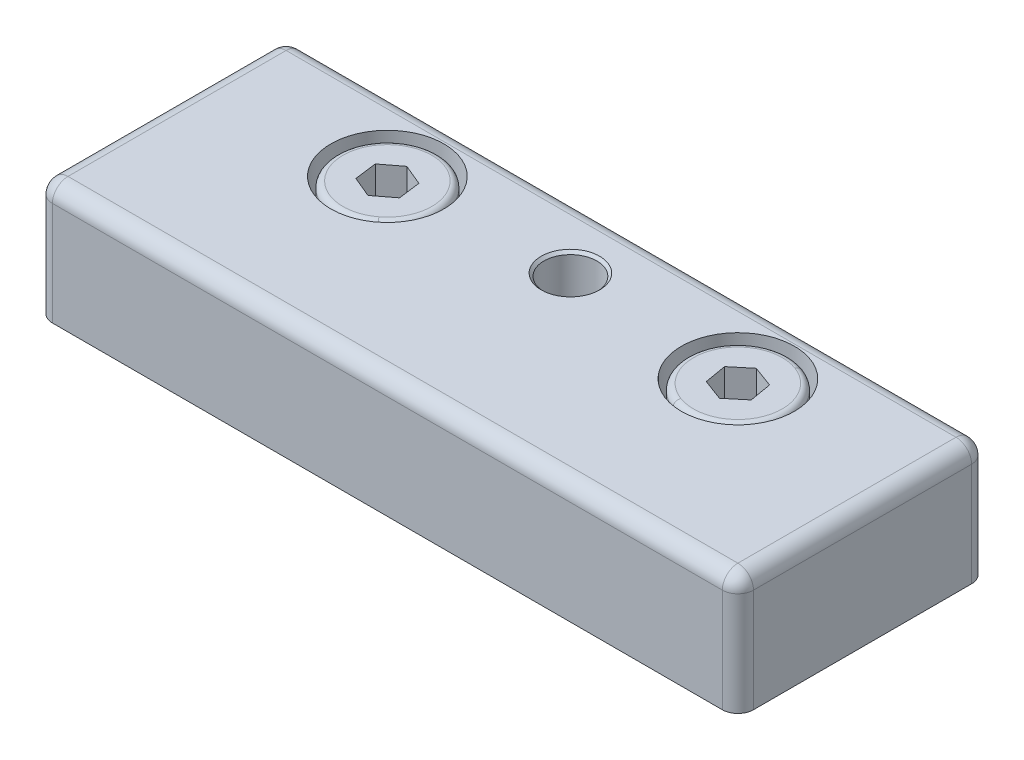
ISO-10303-21;
HEADER;
FILE_DESCRIPTION(('STEP AP214'),'2;1');
FILE_NAME('part.step','',(''),(''),'','','');
FILE_SCHEMA(('AUTOMOTIVE_DESIGN { 1 0 10303 214 1 1 1 1 }'));
ENDSEC;
DATA;
#1=APPLICATION_CONTEXT('core data for automotive mechanical design processes');
#2=APPLICATION_PROTOCOL_DEFINITION('international standard','automotive_design',2000,#1);
#3=PRODUCT_CONTEXT('',#1,'mechanical');
#4=PRODUCT('Part','Part','',(#3));
#5=PRODUCT_RELATED_PRODUCT_CATEGORY('part','',(#4));
#6=PRODUCT_DEFINITION_FORMATION('','',#4);
#7=PRODUCT_DEFINITION_CONTEXT('part definition',#1,'design');
#8=PRODUCT_DEFINITION('design','',#6,#7);
#9=PRODUCT_DEFINITION_SHAPE('','',#8);
#10=(LENGTH_UNIT() NAMED_UNIT(*) SI_UNIT(.MILLI.,.METRE.));
#11=(NAMED_UNIT(*) PLANE_ANGLE_UNIT() SI_UNIT($,.RADIAN.));
#12=(NAMED_UNIT(*) SI_UNIT($,.STERADIAN.) SOLID_ANGLE_UNIT());
#13=UNCERTAINTY_MEASURE_WITH_UNIT(LENGTH_MEASURE(1.E-05),#10,'distance_accuracy_value','');
#14=(GEOMETRIC_REPRESENTATION_CONTEXT(3) GLOBAL_UNCERTAINTY_ASSIGNED_CONTEXT((#13)) GLOBAL_UNIT_ASSIGNED_CONTEXT((#10,
#11,#12)) REPRESENTATION_CONTEXT('',''));
#15=CARTESIAN_POINT('',(0.,0.,0.));
#16=DIRECTION('',(0.,0.,1.));
#17=DIRECTION('',(1.,0.,0.));
#18=AXIS2_PLACEMENT_3D('',#15,#16,#17);
#19=CARTESIAN_POINT('',(-19.0348133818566,0.99102667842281,-6.72588009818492));
#20=DIRECTION('',(0.,1.,0.));
#21=DIRECTION('',(-0.606676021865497,0.,-0.794949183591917));
#22=AXIS2_PLACEMENT_3D('',#19,#20,#21);
#23=CONICAL_SURFACE('',#22,2.5,1.0471975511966);
#24=DIRECTION('',(0.525396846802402,0.5,0.688446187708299));
#25=VECTOR('',#24,1.);
#26=CARTESIAN_POINT('',(-17.5181233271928,0.99102667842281,-4.73850713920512));
#27=LINE('',#26,#25);
#28=CARTESIAN_POINT('',(-19.0348133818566,-0.452348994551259,-6.72588009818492));
#29=VERTEX_POINT('',#28);
#30=CARTESIAN_POINT('',(-17.5181233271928,0.99102667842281,-4.73850713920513));
#31=VERTEX_POINT('',#30);
#32=EDGE_CURVE('P0_E333',#29,#31,#27,.T.);
#33=ORIENTED_EDGE('',*,*,#32,.F.);
#34=DIRECTION('',(-0.525396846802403,0.5,-0.688446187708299));
#35=VECTOR('',#34,1.);
#36=CARTESIAN_POINT('',(-20.5515034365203,0.99102667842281,-8.71325305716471));
#37=LINE('',#36,#35);
#38=CARTESIAN_POINT('',(-20.5515034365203,0.99102667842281,-8.71325305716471));
#39=VERTEX_POINT('',#38);
#40=EDGE_CURVE('P0_E336',#29,#39,#37,.T.);
#41=ORIENTED_EDGE('',*,*,#40,.T.);
#42=CARTESIAN_POINT('',(-19.0348133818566,0.99102667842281,-6.72588009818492));
#43=DIRECTION('',(0.,1.,0.));
#44=DIRECTION('',(-0.606676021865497,0.,-0.794949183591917));
#45=AXIS2_PLACEMENT_3D('',#42,#43,#44);
#46=CIRCLE('',#45,2.5);
#47=CARTESIAN_POINT('',(-21.5142738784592,0.99102667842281,-6.4060744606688));
#48=VERTEX_POINT('',#47);
#49=EDGE_CURVE('P0_E10',#39,#48,#46,.T.);
#50=ORIENTED_EDGE('',*,*,#49,.T.);
#51=CARTESIAN_POINT('',(-19.0348133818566,0.99102667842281,-6.72588009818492));
#52=DIRECTION('',(0.,1.,0.));
#53=DIRECTION('',(-0.606676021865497,0.,-0.794949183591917));
#54=AXIS2_PLACEMENT_3D('',#51,#52,#53);
#55=CIRCLE('',#54,2.5);
#56=CARTESIAN_POINT('',(-19.9975838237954,0.99102667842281,-4.41870150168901));
#57=VERTEX_POINT('',#56);
#58=EDGE_CURVE('P0_E26',#48,#57,#55,.T.);
#59=ORIENTED_EDGE('',*,*,#58,.T.);
#60=CARTESIAN_POINT('',(-19.0348133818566,0.99102667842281,-6.72588009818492));
#61=DIRECTION('',(0.,1.,0.));
#62=DIRECTION('',(-0.606676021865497,0.,-0.794949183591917));
#63=AXIS2_PLACEMENT_3D('',#60,#61,#62);
#64=CIRCLE('',#63,2.5);
#65=EDGE_CURVE('P0_E19',#57,#31,#64,.T.);
#66=ORIENTED_EDGE('',*,*,#65,.T.);
#67=EDGE_LOOP('',(#33,#41,#50,#59,#66));
#68=FACE_BOUND('',#67,.T.);
#69=ADVANCED_FACE('P0_F16',(#68),#23,.F.);
#70=CARTESIAN_POINT('',(-21.6989137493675,0.99102667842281,-7.83759164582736));
#71=DIRECTION('',(0.,1.,0.));
#72=DIRECTION('',(-0.606676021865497,0.,-0.794949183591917));
#73=AXIS2_PLACEMENT_3D('',#70,#71,#72);
#74=PLANE('',#73);
#75=ORIENTED_EDGE('',*,*,#49,.F.);
#76=DIRECTION('',(-0.794949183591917,0.,0.606676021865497));
#77=VECTOR('',#76,1.);
#78=CARTESIAN_POINT('',(-19.4040931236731,0.99102667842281,-9.58891446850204));
#79=LINE('',#78,#77);
#80=CARTESIAN_POINT('',(-21.6989137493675,0.99102667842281,-7.83759164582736));
#81=VERTEX_POINT('',#80);
#82=EDGE_CURVE('P0_E294',#39,#81,#79,.T.);
#83=ORIENTED_EDGE('',*,*,#82,.T.);
#84=DIRECTION('',(-0.127922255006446,0.,-0.991784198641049));
#85=VECTOR('',#84,1.);
#86=CARTESIAN_POINT('',(-21.3296340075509,0.99102667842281,-4.97455727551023));
#87=LINE('',#86,#85);
#88=EDGE_CURVE('P0_E275',#48,#81,#87,.T.);
#89=ORIENTED_EDGE('',*,*,#88,.F.);
#90=EDGE_LOOP('',(#75,#83,#89));
#91=FACE_BOUND('',#90,.T.);
#92=ADVANCED_FACE('P0_F598',(#91),#74,.T.);
#93=CARTESIAN_POINT('',(-21.6989137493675,0.99102667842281,-7.83759164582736));
#94=DIRECTION('',(0.,1.,0.));
#95=DIRECTION('',(-0.606676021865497,0.,-0.794949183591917));
#96=AXIS2_PLACEMENT_3D('',#93,#94,#95);
#97=PLANE('',#96);
#98=ORIENTED_EDGE('',*,*,#58,.F.);
#99=DIRECTION('',(-0.127922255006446,0.,-0.991784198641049));
#100=VECTOR('',#99,1.);
#101=CARTESIAN_POINT('',(-21.3296340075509,0.99102667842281,-4.97455727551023));
#102=LINE('',#101,#100);
#103=CARTESIAN_POINT('',(-21.3296340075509,0.99102667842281,-4.97455727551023));
#104=VERTEX_POINT('',#103);
#105=EDGE_CURVE('P0_E271',#104,#48,#102,.T.);
#106=ORIENTED_EDGE('',*,*,#105,.F.);
#107=DIRECTION('',(0.922871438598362,0.,0.385108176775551));
#108=VECTOR('',#107,1.);
#109=CARTESIAN_POINT('',(-21.3296340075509,0.99102667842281,-4.97455727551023));
#110=LINE('',#109,#108);
#111=EDGE_CURVE('P0_E207',#104,#57,#110,.T.);
#112=ORIENTED_EDGE('',*,*,#111,.T.);
#113=EDGE_LOOP('',(#98,#106,#112));
#114=FACE_BOUND('',#113,.T.);
#115=ADVANCED_FACE('P0_F599',(#114),#97,.T.);
#116=CARTESIAN_POINT('',(-21.6989137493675,0.99102667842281,-7.83759164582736));
#117=DIRECTION('',(0.,1.,0.));
#118=DIRECTION('',(-0.606676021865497,0.,-0.794949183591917));
#119=AXIS2_PLACEMENT_3D('',#116,#117,#118);
#120=PLANE('',#119);
#121=ORIENTED_EDGE('',*,*,#65,.F.);
#122=DIRECTION('',(0.922871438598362,0.,0.385108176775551));
#123=VECTOR('',#122,1.);
#124=CARTESIAN_POINT('',(-21.3296340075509,0.99102667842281,-4.97455727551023));
#125=LINE('',#124,#123);
#126=CARTESIAN_POINT('',(-18.66553364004,0.99102667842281,-3.86284572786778));
#127=VERTEX_POINT('',#126);
#128=EDGE_CURVE('P0_E205',#57,#127,#125,.T.);
#129=ORIENTED_EDGE('',*,*,#128,.T.);
#130=DIRECTION('',(0.794949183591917,0.,-0.606676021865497));
#131=VECTOR('',#130,1.);
#132=CARTESIAN_POINT('',(-18.66553364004,0.99102667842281,-3.86284572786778));
#133=LINE('',#132,#131);
#134=EDGE_CURVE('P0_E175',#127,#31,#133,.T.);
#135=ORIENTED_EDGE('',*,*,#134,.T.);
#136=EDGE_LOOP('',(#121,#129,#135));
#137=FACE_BOUND('',#136,.T.);
#138=ADVANCED_FACE('P0_F609',(#137),#120,.T.);
#139=CARTESIAN_POINT('',(-21.6989137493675,0.99102667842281,-7.83759164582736));
#140=DIRECTION('',(0.,1.,0.));
#141=DIRECTION('',(-0.606676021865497,0.,-0.794949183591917));
#142=AXIS2_PLACEMENT_3D('',#139,#140,#141);
#143=PLANE('',#142);
#144=CARTESIAN_POINT('',(-19.0348133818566,0.99102667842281,-6.72588009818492));
#145=DIRECTION('',(0.,1.,0.));
#146=DIRECTION('',(-0.606676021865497,0.,-0.794949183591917));
#147=AXIS2_PLACEMENT_3D('',#144,#145,#146);
#148=CIRCLE('',#147,2.5);
#149=CARTESIAN_POINT('',(-16.5553528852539,0.99102667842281,-7.04568573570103));
#150=VERTEX_POINT('',#149);
#151=EDGE_CURVE('P0_E170',#31,#150,#148,.T.);
#152=ORIENTED_EDGE('',*,*,#151,.F.);
#153=DIRECTION('',(0.794949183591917,0.,-0.606676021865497));
#154=VECTOR('',#153,1.);
#155=CARTESIAN_POINT('',(-18.66553364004,0.99102667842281,-3.86284572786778));
#156=LINE('',#155,#154);
#157=CARTESIAN_POINT('',(-16.3707130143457,0.99102667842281,-5.61416855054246));
#158=VERTEX_POINT('',#157);
#159=EDGE_CURVE('P0_E163',#31,#158,#156,.T.);
#160=ORIENTED_EDGE('',*,*,#159,.T.);
#161=DIRECTION('',(0.127922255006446,0.,0.991784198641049));
#162=VECTOR('',#161,1.);
#163=CARTESIAN_POINT('',(-16.7399927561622,0.99102667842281,-8.47720292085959));
#164=LINE('',#163,#162);
#165=EDGE_CURVE('P0_E167',#150,#158,#164,.T.);
#166=ORIENTED_EDGE('',*,*,#165,.F.);
#167=EDGE_LOOP('',(#152,#160,#166));
#168=FACE_BOUND('',#167,.T.);
#169=ADVANCED_FACE('P0_F165',(#168),#143,.T.);
#170=CARTESIAN_POINT('',(-21.6989137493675,0.99102667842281,-7.83759164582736));
#171=DIRECTION('',(0.,1.,0.));
#172=DIRECTION('',(-0.606676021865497,0.,-0.794949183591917));
#173=AXIS2_PLACEMENT_3D('',#170,#171,#172);
#174=PLANE('',#173);
#175=CARTESIAN_POINT('',(-19.0348133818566,0.99102667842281,-6.72588009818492));
#176=DIRECTION('',(0.,1.,0.));
#177=DIRECTION('',(-0.606676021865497,0.,-0.794949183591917));
#178=AXIS2_PLACEMENT_3D('',#175,#176,#177);
#179=CIRCLE('',#178,2.5);
#180=CARTESIAN_POINT('',(-18.0720429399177,0.99102667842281,-9.03305869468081));
#181=VERTEX_POINT('',#180);
#182=EDGE_CURVE('P0_E317',#150,#181,#179,.T.);
#183=ORIENTED_EDGE('',*,*,#182,.F.);
#184=DIRECTION('',(0.127922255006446,0.,0.991784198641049));
#185=VECTOR('',#184,1.);
#186=CARTESIAN_POINT('',(-16.7399927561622,0.99102667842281,-8.47720292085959));
#187=LINE('',#186,#185);
#188=CARTESIAN_POINT('',(-16.7399927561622,0.99102667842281,-8.47720292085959));
#189=VERTEX_POINT('',#188);
#190=EDGE_CURVE('P0_E189',#189,#150,#187,.T.);
#191=ORIENTED_EDGE('',*,*,#190,.F.);
#192=DIRECTION('',(0.922871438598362,0.,0.385108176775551));
#193=VECTOR('',#192,1.);
#194=CARTESIAN_POINT('',(-19.4040931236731,0.99102667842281,-9.58891446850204));
#195=LINE('',#194,#193);
#196=EDGE_CURVE('P0_E291',#181,#189,#195,.T.);
#197=ORIENTED_EDGE('',*,*,#196,.F.);
#198=EDGE_LOOP('',(#183,#191,#197));
#199=FACE_BOUND('',#198,.T.);
#200=ADVANCED_FACE('P0_F315',(#199),#174,.T.);
#201=CARTESIAN_POINT('',(-21.6989137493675,0.99102667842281,-7.83759164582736));
#202=DIRECTION('',(0.,1.,0.));
#203=DIRECTION('',(-0.606676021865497,0.,-0.794949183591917));
#204=AXIS2_PLACEMENT_3D('',#201,#202,#203);
#205=PLANE('',#204);
#206=CARTESIAN_POINT('',(-19.0348133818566,0.99102667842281,-6.72588009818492));
#207=DIRECTION('',(0.,1.,0.));
#208=DIRECTION('',(-0.606676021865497,0.,-0.794949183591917));
#209=AXIS2_PLACEMENT_3D('',#206,#207,#208);
#210=CIRCLE('',#209,2.5);
#211=EDGE_CURVE('P0_E344',#181,#39,#210,.T.);
#212=ORIENTED_EDGE('',*,*,#211,.F.);
#213=DIRECTION('',(0.922871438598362,0.,0.385108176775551));
#214=VECTOR('',#213,1.);
#215=CARTESIAN_POINT('',(-19.4040931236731,0.99102667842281,-9.58891446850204));
#216=LINE('',#215,#214);
#217=CARTESIAN_POINT('',(-19.4040931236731,0.99102667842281,-9.58891446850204));
#218=VERTEX_POINT('',#217);
#219=EDGE_CURVE('P0_E302',#218,#181,#216,.T.);
#220=ORIENTED_EDGE('',*,*,#219,.F.);
#221=DIRECTION('',(-0.794949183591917,0.,0.606676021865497));
#222=VECTOR('',#221,1.);
#223=CARTESIAN_POINT('',(-19.4040931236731,0.99102667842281,-9.58891446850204));
#224=LINE('',#223,#222);
#225=EDGE_CURVE('P0_E297',#218,#39,#224,.T.);
#226=ORIENTED_EDGE('',*,*,#225,.T.);
#227=EDGE_LOOP('',(#212,#220,#226));
#228=FACE_BOUND('',#227,.T.);
#229=ADVANCED_FACE('P0_F590',(#228),#205,.T.);
#230=CARTESIAN_POINT('',(-21.3296340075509,0.99102667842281,-4.97455727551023));
#231=DIRECTION('',(-0.385108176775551,0.,0.922871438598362));
#232=DIRECTION('',(0.,1.,0.));
#233=AXIS2_PLACEMENT_3D('',#230,#231,#232);
#234=PLANE('',#233);
#235=DIRECTION('',(0.922871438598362,0.,0.385108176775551));
#236=VECTOR('',#235,1.);
#237=CARTESIAN_POINT('',(-21.3296340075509,4.79102667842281,-4.97455727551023));
#238=LINE('',#237,#236);
#239=CARTESIAN_POINT('',(-21.3296340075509,4.79102667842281,-4.97455727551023));
#240=VERTEX_POINT('',#239);
#241=CARTESIAN_POINT('',(-18.66553364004,4.79102667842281,-3.86284572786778));
#242=VERTEX_POINT('',#241);
#243=EDGE_CURVE('P0_E260',#240,#242,#238,.T.);
#244=ORIENTED_EDGE('',*,*,#243,.T.);
#245=DIRECTION('',(0.,1.,0.));
#246=VECTOR('',#245,1.);
#247=CARTESIAN_POINT('',(-18.66553364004,0.99102667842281,-3.86284572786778));
#248=LINE('',#247,#246);
#249=EDGE_CURVE('P0_E203',#127,#242,#248,.T.);
#250=ORIENTED_EDGE('',*,*,#249,.F.);
#251=ORIENTED_EDGE('',*,*,#128,.F.);
#252=ORIENTED_EDGE('',*,*,#111,.F.);
#253=DIRECTION('',(0.,1.,0.));
#254=VECTOR('',#253,1.);
#255=CARTESIAN_POINT('',(-21.3296340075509,0.99102667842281,-4.97455727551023));
#256=LINE('',#255,#254);
#257=EDGE_CURVE('P0_E276',#104,#240,#256,.T.);
#258=ORIENTED_EDGE('',*,*,#257,.T.);
#259=EDGE_LOOP('',(#244,#250,#251,#252,#258));
#260=FACE_BOUND('',#259,.T.);
#261=ADVANCED_FACE('P0_F606',(#260),#234,.F.);
#262=CARTESIAN_POINT('',(-18.66553364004,0.99102667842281,-3.86284572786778));
#263=DIRECTION('',(0.606676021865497,0.,0.794949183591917));
#264=DIRECTION('',(0.794949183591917,0.,-0.606676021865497));
#265=AXIS2_PLACEMENT_3D('',#262,#263,#264);
#266=PLANE('',#265);
#267=DIRECTION('',(0.794949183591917,0.,-0.606676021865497));
#268=VECTOR('',#267,1.);
#269=CARTESIAN_POINT('',(-18.66553364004,4.79102667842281,-3.86284572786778));
#270=LINE('',#269,#268);
#271=CARTESIAN_POINT('',(-16.3707130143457,4.79102667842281,-5.61416855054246));
#272=VERTEX_POINT('',#271);
#273=EDGE_CURVE('P0_E181',#242,#272,#270,.T.);
#274=ORIENTED_EDGE('',*,*,#273,.T.);
#275=DIRECTION('',(0.,1.,0.));
#276=VECTOR('',#275,1.);
#277=CARTESIAN_POINT('',(-16.3707130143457,0.99102667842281,-5.61416855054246));
#278=LINE('',#277,#276);
#279=EDGE_CURVE('P0_E176',#158,#272,#278,.T.);
#280=ORIENTED_EDGE('',*,*,#279,.F.);
#281=ORIENTED_EDGE('',*,*,#159,.F.);
#282=ORIENTED_EDGE('',*,*,#134,.F.);
#283=ORIENTED_EDGE('',*,*,#249,.T.);
#284=EDGE_LOOP('',(#274,#280,#281,#282,#283));
#285=FACE_BOUND('',#284,.T.);
#286=ADVANCED_FACE('P0_F179',(#285),#266,.F.);
#287=CARTESIAN_POINT('',(-16.7399927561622,0.99102667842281,-8.47720292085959));
#288=DIRECTION('',(-0.991784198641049,0.,0.127922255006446));
#289=DIRECTION('',(0.,-1.,0.));
#290=AXIS2_PLACEMENT_3D('',#287,#288,#289);
#291=PLANE('',#290);
#292=DIRECTION('',(0.127922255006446,0.,0.991784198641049));
#293=VECTOR('',#292,1.);
#294=CARTESIAN_POINT('',(-16.7399927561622,4.79102667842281,-8.47720292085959));
#295=LINE('',#294,#293);
#296=CARTESIAN_POINT('',(-16.7399927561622,4.79102667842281,-8.47720292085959));
#297=VERTEX_POINT('',#296);
#298=EDGE_CURVE('P0_E254',#297,#272,#295,.T.);
#299=ORIENTED_EDGE('',*,*,#298,.F.);
#300=DIRECTION('',(0.,1.,0.));
#301=VECTOR('',#300,1.);
#302=CARTESIAN_POINT('',(-16.7399927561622,0.99102667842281,-8.47720292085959));
#303=LINE('',#302,#301);
#304=EDGE_CURVE('P0_E197',#189,#297,#303,.T.);
#305=ORIENTED_EDGE('',*,*,#304,.F.);
#306=ORIENTED_EDGE('',*,*,#190,.T.);
#307=ORIENTED_EDGE('',*,*,#165,.T.);
#308=ORIENTED_EDGE('',*,*,#279,.T.);
#309=EDGE_LOOP('',(#299,#305,#306,#307,#308));
#310=FACE_BOUND('',#309,.T.);
#311=ADVANCED_FACE('P0_F187',(#310),#291,.T.);
#312=CARTESIAN_POINT('',(-19.4040931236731,0.99102667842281,-9.58891446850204));
#313=DIRECTION('',(-0.385108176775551,0.,0.922871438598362));
#314=DIRECTION('',(0.,1.,0.));
#315=AXIS2_PLACEMENT_3D('',#312,#313,#314);
#316=PLANE('',#315);
#317=DIRECTION('',(0.922871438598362,0.,0.385108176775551));
#318=VECTOR('',#317,1.);
#319=CARTESIAN_POINT('',(-19.4040931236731,4.79102667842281,-9.58891446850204));
#320=LINE('',#319,#318);
#321=CARTESIAN_POINT('',(-19.4040931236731,4.79102667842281,-9.58891446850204));
#322=VERTEX_POINT('',#321);
#323=EDGE_CURVE('P0_E257',#322,#297,#320,.T.);
#324=ORIENTED_EDGE('',*,*,#323,.F.);
#325=DIRECTION('',(0.,1.,0.));
#326=VECTOR('',#325,1.);
#327=CARTESIAN_POINT('',(-19.4040931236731,0.99102667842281,-9.58891446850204));
#328=LINE('',#327,#326);
#329=EDGE_CURVE('P0_E301',#218,#322,#328,.T.);
#330=ORIENTED_EDGE('',*,*,#329,.F.);
#331=ORIENTED_EDGE('',*,*,#219,.T.);
#332=ORIENTED_EDGE('',*,*,#196,.T.);
#333=ORIENTED_EDGE('',*,*,#304,.T.);
#334=EDGE_LOOP('',(#324,#330,#331,#332,#333));
#335=FACE_BOUND('',#334,.T.);
#336=ADVANCED_FACE('P0_F311',(#335),#316,.T.);
#337=CARTESIAN_POINT('',(-19.4040931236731,0.99102667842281,-9.58891446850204));
#338=DIRECTION('',(-0.606676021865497,0.,-0.794949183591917));
#339=DIRECTION('',(0.794949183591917,0.,-0.606676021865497));
#340=AXIS2_PLACEMENT_3D('',#337,#338,#339);
#341=PLANE('',#340);
#342=DIRECTION('',(-0.794949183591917,0.,0.606676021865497));
#343=VECTOR('',#342,1.);
#344=CARTESIAN_POINT('',(-19.4040931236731,4.79102667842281,-9.58891446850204));
#345=LINE('',#344,#343);
#346=CARTESIAN_POINT('',(-21.6989137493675,4.79102667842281,-7.83759164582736));
#347=VERTEX_POINT('',#346);
#348=EDGE_CURVE('P0_E251',#322,#347,#345,.T.);
#349=ORIENTED_EDGE('',*,*,#348,.T.);
#350=DIRECTION('',(0.,1.,0.));
#351=VECTOR('',#350,1.);
#352=CARTESIAN_POINT('',(-21.6989137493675,0.99102667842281,-7.83759164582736));
#353=LINE('',#352,#351);
#354=EDGE_CURVE('P0_E288',#81,#347,#353,.T.);
#355=ORIENTED_EDGE('',*,*,#354,.F.);
#356=ORIENTED_EDGE('',*,*,#82,.F.);
#357=ORIENTED_EDGE('',*,*,#225,.F.);
#358=ORIENTED_EDGE('',*,*,#329,.T.);
#359=EDGE_LOOP('',(#349,#355,#356,#357,#358));
#360=FACE_BOUND('',#359,.T.);
#361=ADVANCED_FACE('P0_F595',(#360),#341,.F.);
#362=CARTESIAN_POINT('',(-21.3296340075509,0.99102667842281,-4.97455727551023));
#363=DIRECTION('',(0.991784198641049,0.,-0.127922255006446));
#364=DIRECTION('',(0.127922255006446,0.,0.991784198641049));
#365=AXIS2_PLACEMENT_3D('',#362,#363,#364);
#366=PLANE('',#365);
#367=DIRECTION('',(-0.127922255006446,0.,-0.991784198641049));
#368=VECTOR('',#367,1.);
#369=CARTESIAN_POINT('',(-21.3296340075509,4.79102667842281,-4.97455727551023));
#370=LINE('',#369,#368);
#371=EDGE_CURVE('P0_E247',#240,#347,#370,.T.);
#372=ORIENTED_EDGE('',*,*,#371,.F.);
#373=ORIENTED_EDGE('',*,*,#257,.F.);
#374=ORIENTED_EDGE('',*,*,#105,.T.);
#375=ORIENTED_EDGE('',*,*,#88,.T.);
#376=ORIENTED_EDGE('',*,*,#354,.T.);
#377=EDGE_LOOP('',(#372,#373,#374,#375,#376));
#378=FACE_BOUND('',#377,.T.);
#379=ADVANCED_FACE('P0_F603',(#378),#366,.T.);
#380=CARTESIAN_POINT('',(-19.0348133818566,3.99102667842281,-6.72588009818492));
#381=DIRECTION('',(0.,1.,0.));
#382=DIRECTION('',(-0.606676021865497,0.,-0.794949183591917));
#383=AXIS2_PLACEMENT_3D('',#380,#381,#382);
#384=TOROIDAL_SURFACE('',#383,5.7,0.8);
#385=CARTESIAN_POINT('',(-15.5767600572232,3.99102667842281,-2.19466975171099));
#386=DIRECTION('',(-0.794949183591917,0.,0.606676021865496));
#387=DIRECTION('',(-0.606676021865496,0.,-0.794949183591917));
#388=AXIS2_PLACEMENT_3D('',#385,#386,#387);
#389=CIRCLE('',#388,0.8);
#390=CARTESIAN_POINT('',(-15.0914192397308,3.99102667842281,-1.55871040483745));
#391=VERTEX_POINT('',#390);
#392=CARTESIAN_POINT('',(-15.5767600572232,4.79102667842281,-2.19466975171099));
#393=VERTEX_POINT('',#392);
#394=EDGE_CURVE('P0_E343',#391,#393,#389,.T.);
#395=ORIENTED_EDGE('',*,*,#394,.F.);
#396=CARTESIAN_POINT('',(-19.0348133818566,3.99102667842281,-6.72588009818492));
#397=DIRECTION('',(0.,-1.,0.));
#398=DIRECTION('',(-0.606676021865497,0.,-0.794949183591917));
#399=AXIS2_PLACEMENT_3D('',#396,#397,#398);
#400=CIRCLE('',#399,6.5);
#401=CARTESIAN_POINT('',(-22.9782075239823,3.99102667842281,-11.8930497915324));
#402=VERTEX_POINT('',#401);
#403=EDGE_CURVE('P0_E267',#402,#391,#400,.T.);
#404=ORIENTED_EDGE('',*,*,#403,.F.);
#405=CARTESIAN_POINT('',(-22.4928667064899,3.99102667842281,-11.2570904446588));
#406=DIRECTION('',(0.794949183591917,0.,-0.606676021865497));
#407=DIRECTION('',(0.606676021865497,0.,0.794949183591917));
#408=AXIS2_PLACEMENT_3D('',#405,#406,#407);
#409=CIRCLE('',#408,0.8);
#410=CARTESIAN_POINT('',(-22.4928667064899,4.79102667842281,-11.2570904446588));
#411=VERTEX_POINT('',#410);
#412=EDGE_CURVE('P0_E362',#402,#411,#409,.T.);
#413=ORIENTED_EDGE('',*,*,#412,.T.);
#414=CARTESIAN_POINT('',(-19.0348133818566,4.79102667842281,-6.72588009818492));
#415=DIRECTION('',(0.,1.,0.));
#416=DIRECTION('',(-0.606676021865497,0.,-0.794949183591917));
#417=AXIS2_PLACEMENT_3D('',#414,#415,#416);
#418=CIRCLE('',#417,5.7);
#419=EDGE_CURVE('P0_E244',#393,#411,#418,.T.);
#420=ORIENTED_EDGE('',*,*,#419,.F.);
#421=EDGE_LOOP('',(#395,#404,#413,#420));
#422=FACE_BOUND('',#421,.T.);
#423=ADVANCED_FACE('P0_F640',(#422),#384,.T.);
#424=CARTESIAN_POINT('',(-19.0348133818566,-0.60897332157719,-6.72588009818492));
#425=DIRECTION('',(0.,-1.,0.));
#426=DIRECTION('',(0.606676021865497,0.,0.794949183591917));
#427=AXIS2_PLACEMENT_3D('',#424,#425,#426);
#428=TOROIDAL_SURFACE('',#427,4.39999999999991,0.4);
#429=CARTESIAN_POINT('',(-21.7041878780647,-0.60897332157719,-10.2236565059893));
#430=DIRECTION('',(-0.794949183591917,0.,0.606676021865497));
#431=DIRECTION('',(-0.606676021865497,0.,-0.794949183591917));
#432=AXIS2_PLACEMENT_3D('',#429,#430,#431);
#433=CIRCLE('',#432,0.4);
#434=CARTESIAN_POINT('',(-21.4615174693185,-0.60897332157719,-9.90567683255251));
#435=VERTEX_POINT('',#434);
#436=CARTESIAN_POINT('',(-21.7041878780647,-0.20897332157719,-10.2236565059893));
#437=VERTEX_POINT('',#436);
#438=EDGE_CURVE('P0_E372',#435,#437,#433,.T.);
#439=ORIENTED_EDGE('',*,*,#438,.F.);
#440=CARTESIAN_POINT('',(-19.0348133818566,-0.60897332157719,-6.72588009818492));
#441=DIRECTION('',(0.,-1.,0.));
#442=DIRECTION('',(0.606676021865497,0.,0.794949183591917));
#443=AXIS2_PLACEMENT_3D('',#440,#441,#442);
#444=CIRCLE('',#443,3.99999999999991);
#445=CARTESIAN_POINT('',(-16.6081092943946,-0.60897332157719,-3.54608336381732));
#446=VERTEX_POINT('',#445);
#447=EDGE_CURVE('P0_E227',#446,#435,#444,.T.);
#448=ORIENTED_EDGE('',*,*,#447,.F.);
#449=CARTESIAN_POINT('',(-16.3654388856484,-0.60897332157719,-3.22810369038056));
#450=DIRECTION('',(0.794949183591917,0.,-0.606676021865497));
#451=DIRECTION('',(0.606676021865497,0.,0.794949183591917));
#452=AXIS2_PLACEMENT_3D('',#449,#450,#451);
#453=CIRCLE('',#452,0.4);
#454=CARTESIAN_POINT('',(-16.3654388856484,-0.20897332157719,-3.22810369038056));
#455=VERTEX_POINT('',#454);
#456=EDGE_CURVE('P0_E354',#446,#455,#453,.T.);
#457=ORIENTED_EDGE('',*,*,#456,.T.);
#458=CARTESIAN_POINT('',(-19.0348133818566,-0.20897332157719,-6.72588009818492));
#459=DIRECTION('',(0.,1.,0.));
#460=DIRECTION('',(0.606676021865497,0.,0.794949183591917));
#461=AXIS2_PLACEMENT_3D('',#458,#459,#460);
#462=CIRCLE('',#461,4.39999999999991);
#463=EDGE_CURVE('P0_E270',#437,#455,#462,.T.);
#464=ORIENTED_EDGE('',*,*,#463,.F.);
#465=EDGE_LOOP('',(#439,#448,#457,#464));
#466=FACE_BOUND('',#465,.T.);
#467=ADVANCED_FACE('P0_F643',(#466),#428,.F.);
#468=CARTESIAN_POINT('',(-21.665697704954,-25.2089733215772,-4.71808580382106));
#469=DIRECTION('',(0.,-1.,0.));
#470=DIRECTION('',(-0.794949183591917,0.,0.606676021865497));
#471=AXIS2_PLACEMENT_3D('',#468,#469,#470);
#472=PLANE('',#471);
#473=CARTESIAN_POINT('',(-19.0348133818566,-25.2089733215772,-6.72588009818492));
#474=DIRECTION('',(0.,1.,0.));
#475=DIRECTION('',(-0.606676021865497,0.,-0.794949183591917));
#476=AXIS2_PLACEMENT_3D('',#473,#474,#475);
#477=CIRCLE('',#476,3.3095);
#478=CARTESIAN_POINT('',(-21.0426076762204,-25.2089733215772,-9.35676442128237));
#479=VERTEX_POINT('',#478);
#480=CARTESIAN_POINT('',(-17.0270190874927,-25.2089733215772,-4.09499577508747));
#481=VERTEX_POINT('',#480);
#482=EDGE_CURVE('P0_E350',#479,#481,#477,.T.);
#483=ORIENTED_EDGE('',*,*,#482,.F.);
#484=CARTESIAN_POINT('',(-19.0348133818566,-25.2089733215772,-6.72588009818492));
#485=DIRECTION('',(0.,1.,0.));
#486=DIRECTION('',(-0.606676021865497,0.,-0.794949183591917));
#487=AXIS2_PLACEMENT_3D('',#484,#485,#486);
#488=CIRCLE('',#487,3.3095);
#489=EDGE_CURVE('P0_E280',#481,#479,#488,.T.);
#490=ORIENTED_EDGE('',*,*,#489,.F.);
#491=EDGE_LOOP('',(#483,#490));
#492=FACE_BOUND('',#491,.T.);
#493=ADVANCED_FACE('P0_F649',(#492),#472,.T.);
#494=CARTESIAN_POINT('',(-19.0348133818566,-25.2089733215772,-6.72588009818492));
#495=DIRECTION('',(0.,1.,0.));
#496=DIRECTION('',(-0.606676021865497,0.,-0.794949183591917));
#497=AXIS2_PLACEMENT_3D('',#494,#495,#496);
#498=CONICAL_SURFACE('',#497,3.3095,0.785398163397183);
#499=DIRECTION('',(0.428984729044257,0.707106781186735,0.562113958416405));
#500=VECTOR('',#499,1.);
#501=CARTESIAN_POINT('',(-17.0270190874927,-25.2089733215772,-4.09499577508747));
#502=LINE('',#501,#500);
#503=CARTESIAN_POINT('',(-16.6081092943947,-24.5184733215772,-3.5460833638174));
#504=VERTEX_POINT('',#503);
#505=EDGE_CURVE('P0_E345',#481,#504,#502,.T.);
#506=ORIENTED_EDGE('',*,*,#505,.F.);
#507=ORIENTED_EDGE('',*,*,#489,.T.);
#508=DIRECTION('',(-0.428984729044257,0.707106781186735,-0.562113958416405));
#509=VECTOR('',#508,1.);
#510=CARTESIAN_POINT('',(-21.0426076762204,-25.2089733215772,-9.35676442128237));
#511=LINE('',#510,#509);
#512=CARTESIAN_POINT('',(-21.4615174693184,-24.5184733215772,-9.90567683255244));
#513=VERTEX_POINT('',#512);
#514=EDGE_CURVE('P0_E384',#479,#513,#511,.T.);
#515=ORIENTED_EDGE('',*,*,#514,.T.);
#516=CARTESIAN_POINT('',(-19.0348133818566,-24.5184733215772,-6.72588009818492));
#517=DIRECTION('',(0.,1.,0.));
#518=DIRECTION('',(-0.606676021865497,0.,-0.794949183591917));
#519=AXIS2_PLACEMENT_3D('',#516,#517,#518);
#520=CIRCLE('',#519,3.99999999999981);
#521=EDGE_CURVE('P0_E277',#504,#513,#520,.T.);
#522=ORIENTED_EDGE('',*,*,#521,.F.);
#523=EDGE_LOOP('',(#506,#507,#515,#522));
#524=FACE_BOUND('',#523,.T.);
#525=ADVANCED_FACE('P0_F653',(#524),#498,.T.);
#526=CARTESIAN_POINT('',(-19.0348133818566,36.5410266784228,-6.72588009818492));
#527=DIRECTION('',(0.,1.,0.));
#528=DIRECTION('',(-0.606676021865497,0.,-0.794949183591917));
#529=AXIS2_PLACEMENT_3D('',#526,#527,#528);
#530=CYLINDRICAL_SURFACE('',#529,3.99999999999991);
#531=DIRECTION('',(0.,1.,0.));
#532=VECTOR('',#531,1.);
#533=CARTESIAN_POINT('',(-16.6081092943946,36.5410266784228,-3.54608336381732));
#534=LINE('',#533,#532);
#535=EDGE_CURVE('P0_E225',#504,#446,#534,.T.);
#536=ORIENTED_EDGE('',*,*,#535,.F.);
#537=ORIENTED_EDGE('',*,*,#521,.T.);
#538=DIRECTION('',(0.,1.,0.));
#539=VECTOR('',#538,1.);
#540=CARTESIAN_POINT('',(-21.4615174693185,36.5410266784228,-9.90567683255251));
#541=LINE('',#540,#539);
#542=EDGE_CURVE('P0_E231',#513,#435,#541,.T.);
#543=ORIENTED_EDGE('',*,*,#542,.T.);
#544=CARTESIAN_POINT('',(-19.0348133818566,-0.60897332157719,-6.72588009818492));
#545=DIRECTION('',(0.,-1.,0.));
#546=DIRECTION('',(0.606676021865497,0.,0.794949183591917));
#547=AXIS2_PLACEMENT_3D('',#544,#545,#546);
#548=CIRCLE('',#547,3.99999999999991);
#549=EDGE_CURVE('P0_E366',#435,#446,#548,.T.);
#550=ORIENTED_EDGE('',*,*,#549,.T.);
#551=EDGE_LOOP('',(#536,#537,#543,#550));
#552=FACE_BOUND('',#551,.T.);
#553=ADVANCED_FACE('P0_F414',(#552),#530,.T.);
#554=CARTESIAN_POINT('',(-24.201983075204,-0.20897332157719,-2.78248595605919));
#555=DIRECTION('',(0.,-1.,0.));
#556=DIRECTION('',(-0.794949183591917,0.,0.606676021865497));
#557=AXIS2_PLACEMENT_3D('',#554,#555,#556);
#558=PLANE('',#557);
#559=CARTESIAN_POINT('',(-19.0348133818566,-0.20897332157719,-6.72588009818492));
#560=DIRECTION('',(0.,1.,0.));
#561=DIRECTION('',(0.606676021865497,0.,0.794949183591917));
#562=AXIS2_PLACEMENT_3D('',#559,#560,#561);
#563=CIRCLE('',#562,4.39999999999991);
#564=EDGE_CURVE('P0_E376',#455,#437,#563,.T.);
#565=ORIENTED_EDGE('',*,*,#564,.T.);
#566=ORIENTED_EDGE('',*,*,#463,.T.);
#567=EDGE_LOOP('',(#565,#566));
#568=FACE_BOUND('',#567,.T.);
#569=CARTESIAN_POINT('',(-19.0348133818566,-0.20897332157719,-6.72588009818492));
#570=DIRECTION('',(0.,1.,0.));
#571=DIRECTION('',(-0.606676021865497,0.,-0.794949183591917));
#572=AXIS2_PLACEMENT_3D('',#569,#570,#571);
#573=CIRCLE('',#572,6.5);
#574=CARTESIAN_POINT('',(-22.9782075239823,-0.20897332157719,-11.8930497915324));
#575=VERTEX_POINT('',#574);
#576=CARTESIAN_POINT('',(-15.0914192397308,-0.20897332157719,-1.55871040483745));
#577=VERTEX_POINT('',#576);
#578=EDGE_CURVE('P0_E235',#575,#577,#573,.T.);
#579=ORIENTED_EDGE('',*,*,#578,.F.);
#580=CARTESIAN_POINT('',(-19.0348133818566,-0.20897332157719,-6.72588009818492));
#581=DIRECTION('',(0.,1.,0.));
#582=DIRECTION('',(-0.606676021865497,0.,-0.794949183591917));
#583=AXIS2_PLACEMENT_3D('',#580,#581,#582);
#584=CIRCLE('',#583,6.5);
#585=EDGE_CURVE('P0_E264',#577,#575,#584,.T.);
#586=ORIENTED_EDGE('',*,*,#585,.F.);
#587=EDGE_LOOP('',(#579,#586));
#588=FACE_BOUND('',#587,.T.);
#589=ADVANCED_FACE('P0_F659',(#568,#588),#558,.T.);
#590=CARTESIAN_POINT('',(-19.0348133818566,36.5410266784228,-6.72588009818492));
#591=DIRECTION('',(0.,1.,0.));
#592=DIRECTION('',(-0.606676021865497,0.,-0.794949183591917));
#593=AXIS2_PLACEMENT_3D('',#590,#591,#592);
#594=CYLINDRICAL_SURFACE('',#593,6.5);
#595=DIRECTION('',(0.,1.,0.));
#596=VECTOR('',#595,1.);
#597=CARTESIAN_POINT('',(-15.0914192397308,36.5410266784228,-1.55871040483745));
#598=LINE('',#597,#596);
#599=EDGE_CURVE('P0_E236',#577,#391,#598,.T.);
#600=ORIENTED_EDGE('',*,*,#599,.F.);
#601=ORIENTED_EDGE('',*,*,#585,.T.);
#602=DIRECTION('',(0.,1.,0.));
#603=VECTOR('',#602,1.);
#604=CARTESIAN_POINT('',(-22.9782075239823,36.5410266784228,-11.8930497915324));
#605=LINE('',#604,#603);
#606=EDGE_CURVE('P0_E240',#575,#402,#605,.T.);
#607=ORIENTED_EDGE('',*,*,#606,.T.);
#608=ORIENTED_EDGE('',*,*,#403,.T.);
#609=EDGE_LOOP('',(#600,#601,#607,#608));
#610=FACE_BOUND('',#609,.T.);
#611=ADVANCED_FACE('P0_F662',(#610),#594,.T.);
#612=CARTESIAN_POINT('',(-19.0348133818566,4.79102667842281,-6.72588009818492));
#613=DIRECTION('',(0.,1.,0.));
#614=DIRECTION('',(-0.606676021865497,0.,-0.794949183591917));
#615=AXIS2_PLACEMENT_3D('',#612,#613,#614);
#616=PLANE('',#615);
#617=ORIENTED_EDGE('',*,*,#371,.T.);
#618=ORIENTED_EDGE('',*,*,#348,.F.);
#619=ORIENTED_EDGE('',*,*,#323,.T.);
#620=ORIENTED_EDGE('',*,*,#298,.T.);
#621=ORIENTED_EDGE('',*,*,#273,.F.);
#622=ORIENTED_EDGE('',*,*,#243,.F.);
#623=EDGE_LOOP('',(#617,#618,#619,#620,#621,#622));
#624=FACE_BOUND('',#623,.T.);
#625=CARTESIAN_POINT('',(-19.0348133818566,4.79102667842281,-6.72588009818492));
#626=DIRECTION('',(0.,1.,0.));
#627=DIRECTION('',(-0.606676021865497,0.,-0.794949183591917));
#628=AXIS2_PLACEMENT_3D('',#625,#626,#627);
#629=CIRCLE('',#628,5.7);
#630=EDGE_CURVE('P0_E358',#411,#393,#629,.T.);
#631=ORIENTED_EDGE('',*,*,#630,.T.);
#632=ORIENTED_EDGE('',*,*,#419,.T.);
#633=EDGE_LOOP('',(#631,#632));
#634=FACE_BOUND('',#633,.T.);
#635=ADVANCED_FACE('P0_F321',(#624,#634),#616,.T.);
#636=CARTESIAN_POINT('',(-19.0348133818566,36.5410266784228,-6.72588009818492));
#637=DIRECTION('',(0.,1.,0.));
#638=DIRECTION('',(-0.606676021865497,0.,-0.794949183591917));
#639=AXIS2_PLACEMENT_3D('',#636,#637,#638);
#640=CYLINDRICAL_SURFACE('',#639,6.5);
#641=ORIENTED_EDGE('',*,*,#578,.T.);
#642=ORIENTED_EDGE('',*,*,#599,.T.);
#643=CARTESIAN_POINT('',(-19.0348133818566,3.99102667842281,-6.72588009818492));
#644=DIRECTION('',(0.,-1.,0.));
#645=DIRECTION('',(-0.606676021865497,0.,-0.794949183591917));
#646=AXIS2_PLACEMENT_3D('',#643,#644,#645);
#647=CIRCLE('',#646,6.5);
#648=EDGE_CURVE('P0_E339',#391,#402,#647,.T.);
#649=ORIENTED_EDGE('',*,*,#648,.T.);
#650=ORIENTED_EDGE('',*,*,#606,.F.);
#651=EDGE_LOOP('',(#641,#642,#649,#650));
#652=FACE_BOUND('',#651,.T.);
#653=ADVANCED_FACE('P0_F669',(#652),#640,.T.);
#654=CARTESIAN_POINT('',(-19.0348133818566,36.5410266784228,-6.72588009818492));
#655=DIRECTION('',(0.,1.,0.));
#656=DIRECTION('',(-0.606676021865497,0.,-0.794949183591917));
#657=AXIS2_PLACEMENT_3D('',#654,#655,#656);
#658=CYLINDRICAL_SURFACE('',#657,3.99999999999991);
#659=CARTESIAN_POINT('',(-19.0348133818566,-24.5184733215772,-6.72588009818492));
#660=DIRECTION('',(0.,1.,0.));
#661=DIRECTION('',(-0.606676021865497,0.,-0.794949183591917));
#662=AXIS2_PLACEMENT_3D('',#659,#660,#661);
#663=CIRCLE('',#662,3.99999999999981);
#664=EDGE_CURVE('P0_E349',#513,#504,#663,.T.);
#665=ORIENTED_EDGE('',*,*,#664,.T.);
#666=ORIENTED_EDGE('',*,*,#535,.T.);
#667=ORIENTED_EDGE('',*,*,#447,.T.);
#668=ORIENTED_EDGE('',*,*,#542,.F.);
#669=EDGE_LOOP('',(#665,#666,#667,#668));
#670=FACE_BOUND('',#669,.T.);
#671=ADVANCED_FACE('P0_F673',(#670),#658,.T.);
#672=CARTESIAN_POINT('',(-19.0348133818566,-25.2089733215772,-6.72588009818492));
#673=DIRECTION('',(0.,1.,0.));
#674=DIRECTION('',(-0.606676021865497,0.,-0.794949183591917));
#675=AXIS2_PLACEMENT_3D('',#672,#673,#674);
#676=CONICAL_SURFACE('',#675,3.3095,0.785398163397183);
#677=ORIENTED_EDGE('',*,*,#482,.T.);
#678=ORIENTED_EDGE('',*,*,#505,.T.);
#679=ORIENTED_EDGE('',*,*,#664,.F.);
#680=ORIENTED_EDGE('',*,*,#514,.F.);
#681=EDGE_LOOP('',(#677,#678,#679,#680));
#682=FACE_BOUND('',#681,.T.);
#683=ADVANCED_FACE('P0_F670',(#682),#676,.T.);
#684=CARTESIAN_POINT('',(-19.0348133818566,-0.60897332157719,-6.72588009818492));
#685=DIRECTION('',(0.,-1.,0.));
#686=DIRECTION('',(0.606676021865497,0.,0.794949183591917));
#687=AXIS2_PLACEMENT_3D('',#684,#685,#686);
#688=TOROIDAL_SURFACE('',#687,4.39999999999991,0.4);
#689=ORIENTED_EDGE('',*,*,#549,.F.);
#690=ORIENTED_EDGE('',*,*,#438,.T.);
#691=ORIENTED_EDGE('',*,*,#564,.F.);
#692=ORIENTED_EDGE('',*,*,#456,.F.);
#693=EDGE_LOOP('',(#689,#690,#691,#692));
#694=FACE_BOUND('',#693,.T.);
#695=ADVANCED_FACE('P0_F417',(#694),#688,.F.);
#696=CARTESIAN_POINT('',(-19.0348133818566,3.99102667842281,-6.72588009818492));
#697=DIRECTION('',(0.,1.,0.));
#698=DIRECTION('',(-0.606676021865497,0.,-0.794949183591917));
#699=AXIS2_PLACEMENT_3D('',#696,#697,#698);
#700=TOROIDAL_SURFACE('',#699,5.7,0.8);
#701=ORIENTED_EDGE('',*,*,#648,.F.);
#702=ORIENTED_EDGE('',*,*,#394,.T.);
#703=ORIENTED_EDGE('',*,*,#630,.F.);
#704=ORIENTED_EDGE('',*,*,#412,.F.);
#705=EDGE_LOOP('',(#701,#702,#703,#704));
#706=FACE_BOUND('',#705,.T.);
#707=ADVANCED_FACE('P0_F680',(#706),#700,.T.);
#708=CARTESIAN_POINT('',(-19.0348133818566,0.99102667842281,-6.72588009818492));
#709=DIRECTION('',(0.,1.,0.));
#710=DIRECTION('',(-0.606676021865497,0.,-0.794949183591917));
#711=AXIS2_PLACEMENT_3D('',#708,#709,#710);
#712=CONICAL_SURFACE('',#711,2.5,1.0471975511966);
#713=ORIENTED_EDGE('',*,*,#40,.F.);
#714=ORIENTED_EDGE('',*,*,#32,.T.);
#715=ORIENTED_EDGE('',*,*,#151,.T.);
#716=ORIENTED_EDGE('',*,*,#182,.T.);
#717=ORIENTED_EDGE('',*,*,#211,.T.);
#718=EDGE_LOOP('',(#713,#714,#715,#716,#717));
#719=FACE_BOUND('',#718,.T.);
#720=ADVANCED_FACE('P0_F588',(#719),#712,.F.);
#721=CLOSED_SHELL('',(#69,#92,#115,#138,#169,#200,#229,#261,#286,#311,#336,#361,#379,#423,#467,
#493,#525,#553,#589,#611,#635,#653,#671,#683,#695,#707,#720));
#722=MANIFOLD_SOLID_BREP('P0_B1',#721);
#723=CARTESIAN_POINT('',(25.9651866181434,0.99102667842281,-6.72588009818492));
#724=DIRECTION('',(0.,1.,0.));
#725=DIRECTION('',(-0.346767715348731,0.,0.937951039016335));
#726=AXIS2_PLACEMENT_3D('',#723,#724,#725);
#727=CONICAL_SURFACE('',#726,2.5,1.0471975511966);
#728=DIRECTION('',(0.300309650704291,0.5,-0.812289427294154));
#729=VECTOR('',#728,1.);
#730=CARTESIAN_POINT('',(26.8321059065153,0.99102667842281,-9.07075769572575));
#731=LINE('',#730,#729);
#732=CARTESIAN_POINT('',(25.9651866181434,-0.452348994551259,-6.72588009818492));
#733=VERTEX_POINT('',#732);
#734=CARTESIAN_POINT('',(26.8321059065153,0.99102667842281,-9.07075769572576));
#735=VERTEX_POINT('',#734);
#736=EDGE_CURVE('P1_E334',#733,#735,#731,.T.);
#737=ORIENTED_EDGE('',*,*,#736,.F.);
#738=DIRECTION('',(-0.300309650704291,0.5,0.812289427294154));
#739=VECTOR('',#738,1.);
#740=CARTESIAN_POINT('',(25.0982673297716,0.99102667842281,-4.38100250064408));
#741=LINE('',#740,#739);
#742=CARTESIAN_POINT('',(25.0982673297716,0.99102667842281,-4.38100250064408));
#743=VERTEX_POINT('',#742);
#744=EDGE_CURVE('P1_E337',#733,#743,#741,.T.);
#745=ORIENTED_EDGE('',*,*,#744,.T.);
#746=CARTESIAN_POINT('',(25.9651866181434,0.99102667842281,-6.72588009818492));
#747=DIRECTION('',(0.,1.,0.));
#748=DIRECTION('',(-0.346767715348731,0.,0.937951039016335));
#749=AXIS2_PLACEMENT_3D('',#746,#747,#748);
#750=CIRCLE('',#749,2.5);
#751=CARTESIAN_POINT('',(27.5624505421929,0.99102667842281,-4.80266717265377));
#752=VERTEX_POINT('',#751);
#753=EDGE_CURVE('P1_E11',#743,#752,#750,.T.);
#754=ORIENTED_EDGE('',*,*,#753,.T.);
#755=CARTESIAN_POINT('',(25.9651866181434,0.99102667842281,-6.72588009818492));
#756=DIRECTION('',(0.,1.,0.));
#757=DIRECTION('',(-0.346767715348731,0.,0.937951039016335));
#758=AXIS2_PLACEMENT_3D('',#755,#756,#757);
#759=CIRCLE('',#758,2.5);
#760=CARTESIAN_POINT('',(28.4293698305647,0.99102667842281,-7.14754477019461));
#761=VERTEX_POINT('',#760);
#762=EDGE_CURVE('P1_E27',#752,#761,#759,.T.);
#763=ORIENTED_EDGE('',*,*,#762,.T.);
#764=CARTESIAN_POINT('',(25.9651866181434,0.99102667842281,-6.72588009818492));
#765=DIRECTION('',(0.,1.,0.));
#766=DIRECTION('',(-0.346767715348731,0.,0.937951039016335));
#767=AXIS2_PLACEMENT_3D('',#764,#765,#766);
#768=CIRCLE('',#767,2.5);
#769=EDGE_CURVE('P1_E20',#761,#735,#768,.T.);
#770=ORIENTED_EDGE('',*,*,#769,.T.);
#771=EDGE_LOOP('',(#737,#745,#754,#763,#770));
#772=FACE_BOUND('',#771,.T.);
#773=ADVANCED_FACE('P1_F17',(#772),#727,.F.);
#774=CARTESIAN_POINT('',(26.4520830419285,0.99102667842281,-3.88048641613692));
#775=DIRECTION('',(0.,1.,0.));
#776=DIRECTION('',(-0.346767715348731,0.,0.937951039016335));
#777=AXIS2_PLACEMENT_3D('',#774,#775,#776);
#778=PLANE('',#777);
#779=ORIENTED_EDGE('',*,*,#753,.F.);
#780=DIRECTION('',(0.937951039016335,0.,0.34676771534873));
#781=VECTOR('',#780,1.);
#782=CARTESIAN_POINT('',(23.7444516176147,0.99102667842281,-4.88151858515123));
#783=LINE('',#782,#781);
#784=CARTESIAN_POINT('',(26.4520830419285,0.99102667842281,-3.88048641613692));
#785=VERTEX_POINT('',#784);
#786=EDGE_CURVE('P1_E295',#743,#785,#783,.T.);
#787=ORIENTED_EDGE('',*,*,#786,.T.);
#788=DIRECTION('',(-0.76928517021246,0.,0.638905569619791));
#789=VECTOR('',#788,1.);
#790=CARTESIAN_POINT('',(28.6728180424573,0.99102667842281,-5.72484792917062));
#791=LINE('',#790,#789);
#792=EDGE_CURVE('P1_E276',#752,#785,#791,.T.);
#793=ORIENTED_EDGE('',*,*,#792,.F.);
#794=EDGE_LOOP('',(#779,#787,#793));
#795=FACE_BOUND('',#794,.T.);
#796=ADVANCED_FACE('P1_F599',(#795),#778,.T.);
#797=CARTESIAN_POINT('',(26.4520830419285,0.99102667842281,-3.88048641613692));
#798=DIRECTION('',(0.,1.,0.));
#799=DIRECTION('',(-0.346767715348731,0.,0.937951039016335));
#800=AXIS2_PLACEMENT_3D('',#797,#798,#799);
#801=PLANE('',#800);
#802=ORIENTED_EDGE('',*,*,#762,.F.);
#803=DIRECTION('',(-0.76928517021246,0.,0.638905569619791));
#804=VECTOR('',#803,1.);
#805=CARTESIAN_POINT('',(28.6728180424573,0.99102667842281,-5.72484792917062));
#806=LINE('',#805,#804);
#807=CARTESIAN_POINT('',(28.6728180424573,0.99102667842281,-5.72484792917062));
#808=VERTEX_POINT('',#807);
#809=EDGE_CURVE('P1_E272',#808,#752,#806,.T.);
#810=ORIENTED_EDGE('',*,*,#809,.F.);
#811=DIRECTION('',(-0.168665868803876,0.,-0.98567328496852));
#812=VECTOR('',#811,1.);
#813=CARTESIAN_POINT('',(28.6728180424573,0.99102667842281,-5.72484792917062));
#814=LINE('',#813,#812);
#815=EDGE_CURVE('P1_E208',#808,#761,#814,.T.);
#816=ORIENTED_EDGE('',*,*,#815,.T.);
#817=EDGE_LOOP('',(#802,#810,#816));
#818=FACE_BOUND('',#817,.T.);
#819=ADVANCED_FACE('P1_F600',(#818),#801,.T.);
#820=CARTESIAN_POINT('',(26.4520830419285,0.99102667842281,-3.88048641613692));
#821=DIRECTION('',(0.,1.,0.));
#822=DIRECTION('',(-0.346767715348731,0.,0.937951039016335));
#823=AXIS2_PLACEMENT_3D('',#820,#821,#822);
#824=PLANE('',#823);
#825=ORIENTED_EDGE('',*,*,#769,.F.);
#826=DIRECTION('',(-0.168665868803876,0.,-0.98567328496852));
#827=VECTOR('',#826,1.);
#828=CARTESIAN_POINT('',(28.6728180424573,0.99102667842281,-5.72484792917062));
#829=LINE('',#828,#827);
#830=CARTESIAN_POINT('',(28.1859216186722,0.99102667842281,-8.5702416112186));
#831=VERTEX_POINT('',#830);
#832=EDGE_CURVE('P1_E206',#761,#831,#829,.T.);
#833=ORIENTED_EDGE('',*,*,#832,.T.);
#834=DIRECTION('',(-0.937951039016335,0.,-0.34676771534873));
#835=VECTOR('',#834,1.);
#836=CARTESIAN_POINT('',(28.1859216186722,0.99102667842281,-8.5702416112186));
#837=LINE('',#836,#835);
#838=EDGE_CURVE('P1_E176',#831,#735,#837,.T.);
#839=ORIENTED_EDGE('',*,*,#838,.T.);
#840=EDGE_LOOP('',(#825,#833,#839));
#841=FACE_BOUND('',#840,.T.);
#842=ADVANCED_FACE('P1_F610',(#841),#824,.T.);
#843=CARTESIAN_POINT('',(26.4520830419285,0.99102667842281,-3.88048641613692));
#844=DIRECTION('',(0.,1.,0.));
#845=DIRECTION('',(-0.346767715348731,0.,0.937951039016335));
#846=AXIS2_PLACEMENT_3D('',#843,#844,#845);
#847=PLANE('',#846);
#848=CARTESIAN_POINT('',(25.9651866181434,0.99102667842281,-6.72588009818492));
#849=DIRECTION('',(0.,1.,0.));
#850=DIRECTION('',(-0.346767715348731,0.,0.937951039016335));
#851=AXIS2_PLACEMENT_3D('',#848,#849,#850);
#852=CIRCLE('',#851,2.5);
#853=CARTESIAN_POINT('',(24.367922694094,0.99102667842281,-8.64909302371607));
#854=VERTEX_POINT('',#853);
#855=EDGE_CURVE('P1_E171',#735,#854,#852,.T.);
#856=ORIENTED_EDGE('',*,*,#855,.F.);
#857=DIRECTION('',(-0.937951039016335,0.,-0.34676771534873));
#858=VECTOR('',#857,1.);
#859=CARTESIAN_POINT('',(28.1859216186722,0.99102667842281,-8.5702416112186));
#860=LINE('',#859,#858);
#861=CARTESIAN_POINT('',(25.4782901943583,0.99102667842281,-9.57127378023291));
#862=VERTEX_POINT('',#861);
#863=EDGE_CURVE('P1_E164',#735,#862,#860,.T.);
#864=ORIENTED_EDGE('',*,*,#863,.T.);
#865=DIRECTION('',(0.76928517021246,0.,-0.638905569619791));
#866=VECTOR('',#865,1.);
#867=CARTESIAN_POINT('',(23.2575551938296,0.99102667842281,-7.72691226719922));
#868=LINE('',#867,#866);
#869=EDGE_CURVE('P1_E168',#854,#862,#868,.T.);
#870=ORIENTED_EDGE('',*,*,#869,.F.);
#871=EDGE_LOOP('',(#856,#864,#870));
#872=FACE_BOUND('',#871,.T.);
#873=ADVANCED_FACE('P1_F166',(#872),#847,.T.);
#874=CARTESIAN_POINT('',(26.4520830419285,0.99102667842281,-3.88048641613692));
#875=DIRECTION('',(0.,1.,0.));
#876=DIRECTION('',(-0.346767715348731,0.,0.937951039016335));
#877=AXIS2_PLACEMENT_3D('',#874,#875,#876);
#878=PLANE('',#877);
#879=CARTESIAN_POINT('',(25.9651866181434,0.99102667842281,-6.72588009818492));
#880=DIRECTION('',(0.,1.,0.));
#881=DIRECTION('',(-0.346767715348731,0.,0.937951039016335));
#882=AXIS2_PLACEMENT_3D('',#879,#880,#881);
#883=CIRCLE('',#882,2.5);
#884=CARTESIAN_POINT('',(23.5010034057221,0.99102667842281,-6.30421542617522));
#885=VERTEX_POINT('',#884);
#886=EDGE_CURVE('P1_E318',#854,#885,#883,.T.);
#887=ORIENTED_EDGE('',*,*,#886,.F.);
#888=DIRECTION('',(0.76928517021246,0.,-0.638905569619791));
#889=VECTOR('',#888,1.);
#890=CARTESIAN_POINT('',(23.2575551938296,0.99102667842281,-7.72691226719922));
#891=LINE('',#890,#889);
#892=CARTESIAN_POINT('',(23.2575551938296,0.99102667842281,-7.72691226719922));
#893=VERTEX_POINT('',#892);
#894=EDGE_CURVE('P1_E190',#893,#854,#891,.T.);
#895=ORIENTED_EDGE('',*,*,#894,.F.);
#896=DIRECTION('',(-0.168665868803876,0.,-0.98567328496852));
#897=VECTOR('',#896,1.);
#898=CARTESIAN_POINT('',(23.7444516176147,0.99102667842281,-4.88151858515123));
#899=LINE('',#898,#897);
#900=EDGE_CURVE('P1_E292',#885,#893,#899,.T.);
#901=ORIENTED_EDGE('',*,*,#900,.F.);
#902=EDGE_LOOP('',(#887,#895,#901));
#903=FACE_BOUND('',#902,.T.);
#904=ADVANCED_FACE('P1_F316',(#903),#878,.T.);
#905=CARTESIAN_POINT('',(26.4520830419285,0.99102667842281,-3.88048641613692));
#906=DIRECTION('',(0.,1.,0.));
#907=DIRECTION('',(-0.346767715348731,0.,0.937951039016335));
#908=AXIS2_PLACEMENT_3D('',#905,#906,#907);
#909=PLANE('',#908);
#910=CARTESIAN_POINT('',(25.9651866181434,0.99102667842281,-6.72588009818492));
#911=DIRECTION('',(0.,1.,0.));
#912=DIRECTION('',(-0.346767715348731,0.,0.937951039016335));
#913=AXIS2_PLACEMENT_3D('',#910,#911,#912);
#914=CIRCLE('',#913,2.5);
#915=EDGE_CURVE('P1_E345',#885,#743,#914,.T.);
#916=ORIENTED_EDGE('',*,*,#915,.F.);
#917=DIRECTION('',(-0.168665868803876,0.,-0.98567328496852));
#918=VECTOR('',#917,1.);
#919=CARTESIAN_POINT('',(23.7444516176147,0.99102667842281,-4.88151858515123));
#920=LINE('',#919,#918);
#921=CARTESIAN_POINT('',(23.7444516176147,0.99102667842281,-4.88151858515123));
#922=VERTEX_POINT('',#921);
#923=EDGE_CURVE('P1_E303',#922,#885,#920,.T.);
#924=ORIENTED_EDGE('',*,*,#923,.F.);
#925=DIRECTION('',(0.937951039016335,0.,0.34676771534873));
#926=VECTOR('',#925,1.);
#927=CARTESIAN_POINT('',(23.7444516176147,0.99102667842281,-4.88151858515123));
#928=LINE('',#927,#926);
#929=EDGE_CURVE('P1_E298',#922,#743,#928,.T.);
#930=ORIENTED_EDGE('',*,*,#929,.T.);
#931=EDGE_LOOP('',(#916,#924,#930));
#932=FACE_BOUND('',#931,.T.);
#933=ADVANCED_FACE('P1_F591',(#932),#909,.T.);
#934=CARTESIAN_POINT('',(28.6728180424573,0.99102667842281,-5.72484792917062));
#935=DIRECTION('',(0.98567328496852,0.,-0.168665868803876));
#936=DIRECTION('',(0.,1.,0.));
#937=AXIS2_PLACEMENT_3D('',#934,#935,#936);
#938=PLANE('',#937);
#939=DIRECTION('',(-0.168665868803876,0.,-0.98567328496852));
#940=VECTOR('',#939,1.);
#941=CARTESIAN_POINT('',(28.6728180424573,4.79102667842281,-5.72484792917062));
#942=LINE('',#941,#940);
#943=CARTESIAN_POINT('',(28.6728180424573,4.79102667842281,-5.72484792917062));
#944=VERTEX_POINT('',#943);
#945=CARTESIAN_POINT('',(28.1859216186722,4.79102667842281,-8.5702416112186));
#946=VERTEX_POINT('',#945);
#947=EDGE_CURVE('P1_E261',#944,#946,#942,.T.);
#948=ORIENTED_EDGE('',*,*,#947,.T.);
#949=DIRECTION('',(0.,1.,0.));
#950=VECTOR('',#949,1.);
#951=CARTESIAN_POINT('',(28.1859216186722,0.99102667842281,-8.5702416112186));
#952=LINE('',#951,#950);
#953=EDGE_CURVE('P1_E204',#831,#946,#952,.T.);
#954=ORIENTED_EDGE('',*,*,#953,.F.);
#955=ORIENTED_EDGE('',*,*,#832,.F.);
#956=ORIENTED_EDGE('',*,*,#815,.F.);
#957=DIRECTION('',(0.,1.,0.));
#958=VECTOR('',#957,1.);
#959=CARTESIAN_POINT('',(28.6728180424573,0.99102667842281,-5.72484792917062));
#960=LINE('',#959,#958);
#961=EDGE_CURVE('P1_E277',#808,#944,#960,.T.);
#962=ORIENTED_EDGE('',*,*,#961,.T.);
#963=EDGE_LOOP('',(#948,#954,#955,#956,#962));
#964=FACE_BOUND('',#963,.T.);
#965=ADVANCED_FACE('P1_F607',(#964),#938,.F.);
#966=CARTESIAN_POINT('',(28.1859216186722,0.99102667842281,-8.5702416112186));
#967=DIRECTION('',(0.34676771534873,0.,-0.937951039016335));
#968=DIRECTION('',(-0.937951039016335,0.,-0.34676771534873));
#969=AXIS2_PLACEMENT_3D('',#966,#967,#968);
#970=PLANE('',#969);
#971=DIRECTION('',(-0.937951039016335,0.,-0.34676771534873));
#972=VECTOR('',#971,1.);
#973=CARTESIAN_POINT('',(28.1859216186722,4.79102667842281,-8.5702416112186));
#974=LINE('',#973,#972);
#975=CARTESIAN_POINT('',(25.4782901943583,4.79102667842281,-9.57127378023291));
#976=VERTEX_POINT('',#975);
#977=EDGE_CURVE('P1_E182',#946,#976,#974,.T.);
#978=ORIENTED_EDGE('',*,*,#977,.T.);
#979=DIRECTION('',(0.,1.,0.));
#980=VECTOR('',#979,1.);
#981=CARTESIAN_POINT('',(25.4782901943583,0.99102667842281,-9.57127378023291));
#982=LINE('',#981,#980);
#983=EDGE_CURVE('P1_E177',#862,#976,#982,.T.);
#984=ORIENTED_EDGE('',*,*,#983,.F.);
#985=ORIENTED_EDGE('',*,*,#863,.F.);
#986=ORIENTED_EDGE('',*,*,#838,.F.);
#987=ORIENTED_EDGE('',*,*,#953,.T.);
#988=EDGE_LOOP('',(#978,#984,#985,#986,#987));
#989=FACE_BOUND('',#988,.T.);
#990=ADVANCED_FACE('P1_F180',(#989),#970,.F.);
#991=CARTESIAN_POINT('',(23.2575551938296,0.99102667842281,-7.72691226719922));
#992=DIRECTION('',(0.638905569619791,0.,0.76928517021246));
#993=DIRECTION('',(0.,-1.,0.));
#994=AXIS2_PLACEMENT_3D('',#991,#992,#993);
#995=PLANE('',#994);
#996=DIRECTION('',(0.76928517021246,0.,-0.638905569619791));
#997=VECTOR('',#996,1.);
#998=CARTESIAN_POINT('',(23.2575551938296,4.79102667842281,-7.72691226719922));
#999=LINE('',#998,#997);
#1000=CARTESIAN_POINT('',(23.2575551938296,4.79102667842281,-7.72691226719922));
#1001=VERTEX_POINT('',#1000);
#1002=EDGE_CURVE('P1_E255',#1001,#976,#999,.T.);
#1003=ORIENTED_EDGE('',*,*,#1002,.F.);
#1004=DIRECTION('',(0.,1.,0.));
#1005=VECTOR('',#1004,1.);
#1006=CARTESIAN_POINT('',(23.2575551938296,0.99102667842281,-7.72691226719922));
#1007=LINE('',#1006,#1005);
#1008=EDGE_CURVE('P1_E198',#893,#1001,#1007,.T.);
#1009=ORIENTED_EDGE('',*,*,#1008,.F.);
#1010=ORIENTED_EDGE('',*,*,#894,.T.);
#1011=ORIENTED_EDGE('',*,*,#869,.T.);
#1012=ORIENTED_EDGE('',*,*,#983,.T.);
#1013=EDGE_LOOP('',(#1003,#1009,#1010,#1011,#1012));
#1014=FACE_BOUND('',#1013,.T.);
#1015=ADVANCED_FACE('P1_F188',(#1014),#995,.T.);
#1016=CARTESIAN_POINT('',(23.7444516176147,0.99102667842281,-4.88151858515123));
#1017=DIRECTION('',(0.98567328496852,0.,-0.168665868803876));
#1018=DIRECTION('',(0.,1.,0.));
#1019=AXIS2_PLACEMENT_3D('',#1016,#1017,#1018);
#1020=PLANE('',#1019);
#1021=DIRECTION('',(-0.168665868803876,0.,-0.98567328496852));
#1022=VECTOR('',#1021,1.);
#1023=CARTESIAN_POINT('',(23.7444516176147,4.79102667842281,-4.88151858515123));
#1024=LINE('',#1023,#1022);
#1025=CARTESIAN_POINT('',(23.7444516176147,4.79102667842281,-4.88151858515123));
#1026=VERTEX_POINT('',#1025);
#1027=EDGE_CURVE('P1_E258',#1026,#1001,#1024,.T.);
#1028=ORIENTED_EDGE('',*,*,#1027,.F.);
#1029=DIRECTION('',(0.,1.,0.));
#1030=VECTOR('',#1029,1.);
#1031=CARTESIAN_POINT('',(23.7444516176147,0.99102667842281,-4.88151858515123));
#1032=LINE('',#1031,#1030);
#1033=EDGE_CURVE('P1_E302',#922,#1026,#1032,.T.);
#1034=ORIENTED_EDGE('',*,*,#1033,.F.);
#1035=ORIENTED_EDGE('',*,*,#923,.T.);
#1036=ORIENTED_EDGE('',*,*,#900,.T.);
#1037=ORIENTED_EDGE('',*,*,#1008,.T.);
#1038=EDGE_LOOP('',(#1028,#1034,#1035,#1036,#1037));
#1039=FACE_BOUND('',#1038,.T.);
#1040=ADVANCED_FACE('P1_F312',(#1039),#1020,.T.);
#1041=CARTESIAN_POINT('',(23.7444516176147,0.99102667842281,-4.88151858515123));
#1042=DIRECTION('',(-0.34676771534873,0.,0.937951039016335));
#1043=DIRECTION('',(-0.937951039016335,0.,-0.34676771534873));
#1044=AXIS2_PLACEMENT_3D('',#1041,#1042,#1043);
#1045=PLANE('',#1044);
#1046=DIRECTION('',(0.937951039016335,0.,0.34676771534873));
#1047=VECTOR('',#1046,1.);
#1048=CARTESIAN_POINT('',(23.7444516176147,4.79102667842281,-4.88151858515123));
#1049=LINE('',#1048,#1047);
#1050=CARTESIAN_POINT('',(26.4520830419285,4.79102667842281,-3.88048641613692));
#1051=VERTEX_POINT('',#1050);
#1052=EDGE_CURVE('P1_E252',#1026,#1051,#1049,.T.);
#1053=ORIENTED_EDGE('',*,*,#1052,.T.);
#1054=DIRECTION('',(0.,1.,0.));
#1055=VECTOR('',#1054,1.);
#1056=CARTESIAN_POINT('',(26.4520830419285,0.99102667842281,-3.88048641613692));
#1057=LINE('',#1056,#1055);
#1058=EDGE_CURVE('P1_E289',#785,#1051,#1057,.T.);
#1059=ORIENTED_EDGE('',*,*,#1058,.F.);
#1060=ORIENTED_EDGE('',*,*,#786,.F.);
#1061=ORIENTED_EDGE('',*,*,#929,.F.);
#1062=ORIENTED_EDGE('',*,*,#1033,.T.);
#1063=EDGE_LOOP('',(#1053,#1059,#1060,#1061,#1062));
#1064=FACE_BOUND('',#1063,.T.);
#1065=ADVANCED_FACE('P1_F596',(#1064),#1045,.F.);
#1066=CARTESIAN_POINT('',(28.6728180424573,0.99102667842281,-5.72484792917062));
#1067=DIRECTION('',(-0.638905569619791,0.,-0.76928517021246));
#1068=DIRECTION('',(0.76928517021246,0.,-0.638905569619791));
#1069=AXIS2_PLACEMENT_3D('',#1066,#1067,#1068);
#1070=PLANE('',#1069);
#1071=DIRECTION('',(-0.76928517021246,0.,0.638905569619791));
#1072=VECTOR('',#1071,1.);
#1073=CARTESIAN_POINT('',(28.6728180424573,4.79102667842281,-5.72484792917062));
#1074=LINE('',#1073,#1072);
#1075=EDGE_CURVE('P1_E248',#944,#1051,#1074,.T.);
#1076=ORIENTED_EDGE('',*,*,#1075,.F.);
#1077=ORIENTED_EDGE('',*,*,#961,.F.);
#1078=ORIENTED_EDGE('',*,*,#809,.T.);
#1079=ORIENTED_EDGE('',*,*,#792,.T.);
#1080=ORIENTED_EDGE('',*,*,#1058,.T.);
#1081=EDGE_LOOP('',(#1076,#1077,#1078,#1079,#1080));
#1082=FACE_BOUND('',#1081,.T.);
#1083=ADVANCED_FACE('P1_F604',(#1082),#1070,.T.);
#1084=CARTESIAN_POINT('',(25.9651866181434,3.99102667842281,-6.72588009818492));
#1085=DIRECTION('',(0.,1.,0.));
#1086=DIRECTION('',(-0.346767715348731,0.,0.937951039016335));
#1087=AXIS2_PLACEMENT_3D('',#1084,#1085,#1086);
#1088=TOROIDAL_SURFACE('',#1087,5.7,0.8);
#1089=CARTESIAN_POINT('',(27.9417625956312,3.99102667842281,-12.072201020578));
#1090=DIRECTION('',(0.937951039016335,0.,0.346767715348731));
#1091=DIRECTION('',(-0.346767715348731,0.,0.937951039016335));
#1092=AXIS2_PLACEMENT_3D('',#1089,#1090,#1091);
#1093=CIRCLE('',#1092,0.8);
#1094=CARTESIAN_POINT('',(28.2191767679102,3.99102667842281,-12.8225618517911));
#1095=VERTEX_POINT('',#1094);
#1096=CARTESIAN_POINT('',(27.9417625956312,4.79102667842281,-12.072201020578));
#1097=VERTEX_POINT('',#1096);
#1098=EDGE_CURVE('P1_E344',#1095,#1097,#1093,.T.);
#1099=ORIENTED_EDGE('',*,*,#1098,.F.);
#1100=CARTESIAN_POINT('',(25.9651866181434,3.99102667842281,-6.72588009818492));
#1101=DIRECTION('',(0.,-1.,0.));
#1102=DIRECTION('',(-0.346767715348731,0.,0.937951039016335));
#1103=AXIS2_PLACEMENT_3D('',#1100,#1101,#1102);
#1104=CIRCLE('',#1103,6.5);
#1105=CARTESIAN_POINT('',(23.7111964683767,3.99102667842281,-0.629198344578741));
#1106=VERTEX_POINT('',#1105);
#1107=EDGE_CURVE('P1_E268',#1106,#1095,#1104,.T.);
#1108=ORIENTED_EDGE('',*,*,#1107,.F.);
#1109=CARTESIAN_POINT('',(23.9886106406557,3.99102667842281,-1.37955917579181));
#1110=DIRECTION('',(-0.937951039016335,0.,-0.346767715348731));
#1111=DIRECTION('',(0.346767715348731,0.,-0.937951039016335));
#1112=AXIS2_PLACEMENT_3D('',#1109,#1110,#1111);
#1113=CIRCLE('',#1112,0.8);
#1114=CARTESIAN_POINT('',(23.9886106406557,4.79102667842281,-1.37955917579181));
#1115=VERTEX_POINT('',#1114);
#1116=EDGE_CURVE('P1_E363',#1106,#1115,#1113,.T.);
#1117=ORIENTED_EDGE('',*,*,#1116,.T.);
#1118=CARTESIAN_POINT('',(25.9651866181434,4.79102667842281,-6.72588009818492));
#1119=DIRECTION('',(0.,1.,0.));
#1120=DIRECTION('',(-0.346767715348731,0.,0.937951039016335));
#1121=AXIS2_PLACEMENT_3D('',#1118,#1119,#1120);
#1122=CIRCLE('',#1121,5.7);
#1123=EDGE_CURVE('P1_E245',#1097,#1115,#1122,.T.);
#1124=ORIENTED_EDGE('',*,*,#1123,.F.);
#1125=EDGE_LOOP('',(#1099,#1108,#1117,#1124));
#1126=FACE_BOUND('',#1125,.T.);
#1127=ADVANCED_FACE('P1_F641',(#1126),#1088,.T.);
#1128=CARTESIAN_POINT('',(25.9651866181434,-0.60897332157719,-6.72588009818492));
#1129=DIRECTION('',(0.,-1.,0.));
#1130=DIRECTION('',(0.346767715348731,0.,-0.937951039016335));
#1131=AXIS2_PLACEMENT_3D('',#1128,#1129,#1130);
#1132=TOROIDAL_SURFACE('',#1131,4.39999999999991,0.4);
#1133=CARTESIAN_POINT('',(24.4394086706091,-0.60897332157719,-2.59889552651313));
#1134=DIRECTION('',(0.937951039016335,0.,0.34676771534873));
#1135=DIRECTION('',(-0.34676771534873,0.,0.937951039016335));
#1136=AXIS2_PLACEMENT_3D('',#1133,#1134,#1135);
#1137=CIRCLE('',#1136,0.4);
#1138=CARTESIAN_POINT('',(24.5781157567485,-0.60897332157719,-2.97407594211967));
#1139=VERTEX_POINT('',#1138);
#1140=CARTESIAN_POINT('',(24.4394086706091,-0.20897332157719,-2.59889552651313));
#1141=VERTEX_POINT('',#1140);
#1142=EDGE_CURVE('P1_E373',#1139,#1141,#1137,.T.);
#1143=ORIENTED_EDGE('',*,*,#1142,.F.);
#1144=CARTESIAN_POINT('',(25.9651866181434,-0.60897332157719,-6.72588009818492));
#1145=DIRECTION('',(0.,-1.,0.));
#1146=DIRECTION('',(0.346767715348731,0.,-0.937951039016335));
#1147=AXIS2_PLACEMENT_3D('',#1144,#1145,#1146);
#1148=CIRCLE('',#1147,3.99999999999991);
#1149=CARTESIAN_POINT('',(27.3522574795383,-0.60897332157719,-10.4776842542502));
#1150=VERTEX_POINT('',#1149);
#1151=EDGE_CURVE('P1_E228',#1150,#1139,#1148,.T.);
#1152=ORIENTED_EDGE('',*,*,#1151,.F.);
#1153=CARTESIAN_POINT('',(27.4909645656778,-0.60897332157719,-10.8528646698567));
#1154=DIRECTION('',(-0.937951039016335,0.,-0.346767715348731));
#1155=DIRECTION('',(0.346767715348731,0.,-0.937951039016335));
#1156=AXIS2_PLACEMENT_3D('',#1153,#1154,#1155);
#1157=CIRCLE('',#1156,0.4);
#1158=CARTESIAN_POINT('',(27.4909645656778,-0.20897332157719,-10.8528646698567));
#1159=VERTEX_POINT('',#1158);
#1160=EDGE_CURVE('P1_E355',#1150,#1159,#1157,.T.);
#1161=ORIENTED_EDGE('',*,*,#1160,.T.);
#1162=CARTESIAN_POINT('',(25.9651866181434,-0.20897332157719,-6.72588009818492));
#1163=DIRECTION('',(0.,1.,0.));
#1164=DIRECTION('',(0.346767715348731,0.,-0.937951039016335));
#1165=AXIS2_PLACEMENT_3D('',#1162,#1163,#1164);
#1166=CIRCLE('',#1165,4.39999999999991);
#1167=EDGE_CURVE('P1_E271',#1141,#1159,#1166,.T.);
#1168=ORIENTED_EDGE('',*,*,#1167,.F.);
#1169=EDGE_LOOP('',(#1143,#1152,#1161,#1168));
#1170=FACE_BOUND('',#1169,.T.);
#1171=ADVANCED_FACE('P1_F644',(#1170),#1132,.F.);
#1172=CARTESIAN_POINT('',(29.069335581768,-25.2089733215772,-5.57825234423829));
#1173=DIRECTION('',(0.,-1.,0.));
#1174=DIRECTION('',(0.937951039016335,0.,0.346767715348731));
#1175=AXIS2_PLACEMENT_3D('',#1172,#1173,#1174);
#1176=PLANE('',#1175);
#1177=CARTESIAN_POINT('',(25.9651866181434,-25.2089733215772,-6.72588009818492));
#1178=DIRECTION('',(0.,1.,0.));
#1179=DIRECTION('',(-0.346767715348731,0.,0.937951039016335));
#1180=AXIS2_PLACEMENT_3D('',#1177,#1178,#1179);
#1181=CIRCLE('',#1180,3.3095);
#1182=CARTESIAN_POINT('',(24.8175588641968,-25.2089733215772,-3.62173113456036));
#1183=VERTEX_POINT('',#1182);
#1184=CARTESIAN_POINT('',(27.1128143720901,-25.2089733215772,-9.83002906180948));
#1185=VERTEX_POINT('',#1184);
#1186=EDGE_CURVE('P1_E351',#1183,#1185,#1181,.T.);
#1187=ORIENTED_EDGE('',*,*,#1186,.F.);
#1188=CARTESIAN_POINT('',(25.9651866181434,-25.2089733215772,-6.72588009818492));
#1189=DIRECTION('',(0.,1.,0.));
#1190=DIRECTION('',(-0.346767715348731,0.,0.937951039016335));
#1191=AXIS2_PLACEMENT_3D('',#1188,#1189,#1190);
#1192=CIRCLE('',#1191,3.3095);
#1193=EDGE_CURVE('P1_E281',#1185,#1183,#1192,.T.);
#1194=ORIENTED_EDGE('',*,*,#1193,.F.);
#1195=EDGE_LOOP('',(#1187,#1194));
#1196=FACE_BOUND('',#1195,.T.);
#1197=ADVANCED_FACE('P1_F650',(#1196),#1176,.T.);
#1198=CARTESIAN_POINT('',(25.9651866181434,-25.2089733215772,-6.72588009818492));
#1199=DIRECTION('',(0.,1.,0.));
#1200=DIRECTION('',(-0.346767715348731,0.,0.937951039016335));
#1201=AXIS2_PLACEMENT_3D('',#1198,#1199,#1200);
#1202=CONICAL_SURFACE('',#1201,3.3095,0.785398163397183);
#1203=DIRECTION('',(0.245201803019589,0.707106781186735,-0.663231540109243));
#1204=VECTOR('',#1203,1.);
#1205=CARTESIAN_POINT('',(27.1128143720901,-25.2089733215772,-9.83002906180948));
#1206=LINE('',#1205,#1204);
#1207=CARTESIAN_POINT('',(27.3522574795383,-24.5184733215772,-10.4776842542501));
#1208=VERTEX_POINT('',#1207);
#1209=EDGE_CURVE('P1_E346',#1185,#1208,#1206,.T.);
#1210=ORIENTED_EDGE('',*,*,#1209,.F.);
#1211=ORIENTED_EDGE('',*,*,#1193,.T.);
#1212=DIRECTION('',(-0.245201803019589,0.707106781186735,0.663231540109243));
#1213=VECTOR('',#1212,1.);
#1214=CARTESIAN_POINT('',(24.8175588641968,-25.2089733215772,-3.62173113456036));
#1215=LINE('',#1214,#1213);
#1216=CARTESIAN_POINT('',(24.5781157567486,-24.5184733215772,-2.97407594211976));
#1217=VERTEX_POINT('',#1216);
#1218=EDGE_CURVE('P1_E385',#1183,#1217,#1215,.T.);
#1219=ORIENTED_EDGE('',*,*,#1218,.T.);
#1220=CARTESIAN_POINT('',(25.9651866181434,-24.5184733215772,-6.72588009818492));
#1221=DIRECTION('',(0.,1.,0.));
#1222=DIRECTION('',(-0.346767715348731,0.,0.937951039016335));
#1223=AXIS2_PLACEMENT_3D('',#1220,#1221,#1222);
#1224=CIRCLE('',#1223,3.99999999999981);
#1225=EDGE_CURVE('P1_E278',#1208,#1217,#1224,.T.);
#1226=ORIENTED_EDGE('',*,*,#1225,.F.);
#1227=EDGE_LOOP('',(#1210,#1211,#1219,#1226));
#1228=FACE_BOUND('',#1227,.T.);
#1229=ADVANCED_FACE('P1_F654',(#1228),#1202,.T.);
#1230=CARTESIAN_POINT('',(25.9651866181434,36.5410266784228,-6.72588009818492));
#1231=DIRECTION('',(0.,1.,0.));
#1232=DIRECTION('',(-0.346767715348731,0.,0.937951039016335));
#1233=AXIS2_PLACEMENT_3D('',#1230,#1231,#1232);
#1234=CYLINDRICAL_SURFACE('',#1233,3.99999999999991);
#1235=DIRECTION('',(0.,1.,0.));
#1236=VECTOR('',#1235,1.);
#1237=CARTESIAN_POINT('',(27.3522574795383,36.5410266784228,-10.4776842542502));
#1238=LINE('',#1237,#1236);
#1239=EDGE_CURVE('P1_E226',#1208,#1150,#1238,.T.);
#1240=ORIENTED_EDGE('',*,*,#1239,.F.);
#1241=ORIENTED_EDGE('',*,*,#1225,.T.);
#1242=DIRECTION('',(0.,1.,0.));
#1243=VECTOR('',#1242,1.);
#1244=CARTESIAN_POINT('',(24.5781157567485,36.5410266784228,-2.97407594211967));
#1245=LINE('',#1244,#1243);
#1246=EDGE_CURVE('P1_E232',#1217,#1139,#1245,.T.);
#1247=ORIENTED_EDGE('',*,*,#1246,.T.);
#1248=CARTESIAN_POINT('',(25.9651866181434,-0.60897332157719,-6.72588009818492));
#1249=DIRECTION('',(0.,-1.,0.));
#1250=DIRECTION('',(0.346767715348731,0.,-0.937951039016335));
#1251=AXIS2_PLACEMENT_3D('',#1248,#1249,#1250);
#1252=CIRCLE('',#1251,3.99999999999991);
#1253=EDGE_CURVE('P1_E367',#1139,#1150,#1252,.T.);
#1254=ORIENTED_EDGE('',*,*,#1253,.T.);
#1255=EDGE_LOOP('',(#1240,#1241,#1247,#1254));
#1256=FACE_BOUND('',#1255,.T.);
#1257=ADVANCED_FACE('P1_F415',(#1256),#1234,.T.);
#1258=CARTESIAN_POINT('',(32.0618683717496,-0.20897332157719,-4.47188994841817));
#1259=DIRECTION('',(0.,-1.,0.));
#1260=DIRECTION('',(0.937951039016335,0.,0.346767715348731));
#1261=AXIS2_PLACEMENT_3D('',#1258,#1259,#1260);
#1262=PLANE('',#1261);
#1263=CARTESIAN_POINT('',(25.9651866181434,-0.20897332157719,-6.72588009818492));
#1264=DIRECTION('',(0.,1.,0.));
#1265=DIRECTION('',(0.346767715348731,0.,-0.937951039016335));
#1266=AXIS2_PLACEMENT_3D('',#1263,#1264,#1265);
#1267=CIRCLE('',#1266,4.39999999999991);
#1268=EDGE_CURVE('P1_E377',#1159,#1141,#1267,.T.);
#1269=ORIENTED_EDGE('',*,*,#1268,.T.);
#1270=ORIENTED_EDGE('',*,*,#1167,.T.);
#1271=EDGE_LOOP('',(#1269,#1270));
#1272=FACE_BOUND('',#1271,.T.);
#1273=CARTESIAN_POINT('',(25.9651866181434,-0.20897332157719,-6.72588009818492));
#1274=DIRECTION('',(0.,1.,0.));
#1275=DIRECTION('',(-0.346767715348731,0.,0.937951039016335));
#1276=AXIS2_PLACEMENT_3D('',#1273,#1274,#1275);
#1277=CIRCLE('',#1276,6.5);
#1278=CARTESIAN_POINT('',(23.7111964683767,-0.20897332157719,-0.629198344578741));
#1279=VERTEX_POINT('',#1278);
#1280=CARTESIAN_POINT('',(28.2191767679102,-0.20897332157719,-12.8225618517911));
#1281=VERTEX_POINT('',#1280);
#1282=EDGE_CURVE('P1_E236',#1279,#1281,#1277,.T.);
#1283=ORIENTED_EDGE('',*,*,#1282,.F.);
#1284=CARTESIAN_POINT('',(25.9651866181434,-0.20897332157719,-6.72588009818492));
#1285=DIRECTION('',(0.,1.,0.));
#1286=DIRECTION('',(-0.346767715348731,0.,0.937951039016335));
#1287=AXIS2_PLACEMENT_3D('',#1284,#1285,#1286);
#1288=CIRCLE('',#1287,6.5);
#1289=EDGE_CURVE('P1_E265',#1281,#1279,#1288,.T.);
#1290=ORIENTED_EDGE('',*,*,#1289,.F.);
#1291=EDGE_LOOP('',(#1283,#1290));
#1292=FACE_BOUND('',#1291,.T.);
#1293=ADVANCED_FACE('P1_F660',(#1272,#1292),#1262,.T.);
#1294=CARTESIAN_POINT('',(25.9651866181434,36.5410266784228,-6.72588009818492));
#1295=DIRECTION('',(0.,1.,0.));
#1296=DIRECTION('',(-0.346767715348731,0.,0.937951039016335));
#1297=AXIS2_PLACEMENT_3D('',#1294,#1295,#1296);
#1298=CYLINDRICAL_SURFACE('',#1297,6.5);
#1299=DIRECTION('',(0.,1.,0.));
#1300=VECTOR('',#1299,1.);
#1301=CARTESIAN_POINT('',(28.2191767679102,36.5410266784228,-12.8225618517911));
#1302=LINE('',#1301,#1300);
#1303=EDGE_CURVE('P1_E237',#1281,#1095,#1302,.T.);
#1304=ORIENTED_EDGE('',*,*,#1303,.F.);
#1305=ORIENTED_EDGE('',*,*,#1289,.T.);
#1306=DIRECTION('',(0.,1.,0.));
#1307=VECTOR('',#1306,1.);
#1308=CARTESIAN_POINT('',(23.7111964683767,36.5410266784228,-0.629198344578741));
#1309=LINE('',#1308,#1307);
#1310=EDGE_CURVE('P1_E241',#1279,#1106,#1309,.T.);
#1311=ORIENTED_EDGE('',*,*,#1310,.T.);
#1312=ORIENTED_EDGE('',*,*,#1107,.T.);
#1313=EDGE_LOOP('',(#1304,#1305,#1311,#1312));
#1314=FACE_BOUND('',#1313,.T.);
#1315=ADVANCED_FACE('P1_F663',(#1314),#1298,.T.);
#1316=CARTESIAN_POINT('',(25.9651866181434,4.79102667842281,-6.72588009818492));
#1317=DIRECTION('',(0.,1.,0.));
#1318=DIRECTION('',(-0.346767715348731,0.,0.937951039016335));
#1319=AXIS2_PLACEMENT_3D('',#1316,#1317,#1318);
#1320=PLANE('',#1319);
#1321=ORIENTED_EDGE('',*,*,#1075,.T.);
#1322=ORIENTED_EDGE('',*,*,#1052,.F.);
#1323=ORIENTED_EDGE('',*,*,#1027,.T.);
#1324=ORIENTED_EDGE('',*,*,#1002,.T.);
#1325=ORIENTED_EDGE('',*,*,#977,.F.);
#1326=ORIENTED_EDGE('',*,*,#947,.F.);
#1327=EDGE_LOOP('',(#1321,#1322,#1323,#1324,#1325,#1326));
#1328=FACE_BOUND('',#1327,.T.);
#1329=CARTESIAN_POINT('',(25.9651866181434,4.79102667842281,-6.72588009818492));
#1330=DIRECTION('',(0.,1.,0.));
#1331=DIRECTION('',(-0.346767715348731,0.,0.937951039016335));
#1332=AXIS2_PLACEMENT_3D('',#1329,#1330,#1331);
#1333=CIRCLE('',#1332,5.7);
#1334=EDGE_CURVE('P1_E359',#1115,#1097,#1333,.T.);
#1335=ORIENTED_EDGE('',*,*,#1334,.T.);
#1336=ORIENTED_EDGE('',*,*,#1123,.T.);
#1337=EDGE_LOOP('',(#1335,#1336));
#1338=FACE_BOUND('',#1337,.T.);
#1339=ADVANCED_FACE('P1_F322',(#1328,#1338),#1320,.T.);
#1340=CARTESIAN_POINT('',(25.9651866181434,36.5410266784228,-6.72588009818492));
#1341=DIRECTION('',(0.,1.,0.));
#1342=DIRECTION('',(-0.346767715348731,0.,0.937951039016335));
#1343=AXIS2_PLACEMENT_3D('',#1340,#1341,#1342);
#1344=CYLINDRICAL_SURFACE('',#1343,6.5);
#1345=ORIENTED_EDGE('',*,*,#1282,.T.);
#1346=ORIENTED_EDGE('',*,*,#1303,.T.);
#1347=CARTESIAN_POINT('',(25.9651866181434,3.99102667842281,-6.72588009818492));
#1348=DIRECTION('',(0.,-1.,0.));
#1349=DIRECTION('',(-0.346767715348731,0.,0.937951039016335));
#1350=AXIS2_PLACEMENT_3D('',#1347,#1348,#1349);
#1351=CIRCLE('',#1350,6.5);
#1352=EDGE_CURVE('P1_E340',#1095,#1106,#1351,.T.);
#1353=ORIENTED_EDGE('',*,*,#1352,.T.);
#1354=ORIENTED_EDGE('',*,*,#1310,.F.);
#1355=EDGE_LOOP('',(#1345,#1346,#1353,#1354));
#1356=FACE_BOUND('',#1355,.T.);
#1357=ADVANCED_FACE('P1_F670',(#1356),#1344,.T.);
#1358=CARTESIAN_POINT('',(25.9651866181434,36.5410266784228,-6.72588009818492));
#1359=DIRECTION('',(0.,1.,0.));
#1360=DIRECTION('',(-0.346767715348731,0.,0.937951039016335));
#1361=AXIS2_PLACEMENT_3D('',#1358,#1359,#1360);
#1362=CYLINDRICAL_SURFACE('',#1361,3.99999999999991);
#1363=CARTESIAN_POINT('',(25.9651866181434,-24.5184733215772,-6.72588009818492));
#1364=DIRECTION('',(0.,1.,0.));
#1365=DIRECTION('',(-0.346767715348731,0.,0.937951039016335));
#1366=AXIS2_PLACEMENT_3D('',#1363,#1364,#1365);
#1367=CIRCLE('',#1366,3.99999999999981);
#1368=EDGE_CURVE('P1_E350',#1217,#1208,#1367,.T.);
#1369=ORIENTED_EDGE('',*,*,#1368,.T.);
#1370=ORIENTED_EDGE('',*,*,#1239,.T.);
#1371=ORIENTED_EDGE('',*,*,#1151,.T.);
#1372=ORIENTED_EDGE('',*,*,#1246,.F.);
#1373=EDGE_LOOP('',(#1369,#1370,#1371,#1372));
#1374=FACE_BOUND('',#1373,.T.);
#1375=ADVANCED_FACE('P1_F674',(#1374),#1362,.T.);
#1376=CARTESIAN_POINT('',(25.9651866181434,-25.2089733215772,-6.72588009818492));
#1377=DIRECTION('',(0.,1.,0.));
#1378=DIRECTION('',(-0.346767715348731,0.,0.937951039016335));
#1379=AXIS2_PLACEMENT_3D('',#1376,#1377,#1378);
#1380=CONICAL_SURFACE('',#1379,3.3095,0.785398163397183);
#1381=ORIENTED_EDGE('',*,*,#1186,.T.);
#1382=ORIENTED_EDGE('',*,*,#1209,.T.);
#1383=ORIENTED_EDGE('',*,*,#1368,.F.);
#1384=ORIENTED_EDGE('',*,*,#1218,.F.);
#1385=EDGE_LOOP('',(#1381,#1382,#1383,#1384));
#1386=FACE_BOUND('',#1385,.T.);
#1387=ADVANCED_FACE('P1_F671',(#1386),#1380,.T.);
#1388=CARTESIAN_POINT('',(25.9651866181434,-0.60897332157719,-6.72588009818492));
#1389=DIRECTION('',(0.,-1.,0.));
#1390=DIRECTION('',(0.346767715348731,0.,-0.937951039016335));
#1391=AXIS2_PLACEMENT_3D('',#1388,#1389,#1390);
#1392=TOROIDAL_SURFACE('',#1391,4.39999999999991,0.4);
#1393=ORIENTED_EDGE('',*,*,#1253,.F.);
#1394=ORIENTED_EDGE('',*,*,#1142,.T.);
#1395=ORIENTED_EDGE('',*,*,#1268,.F.);
#1396=ORIENTED_EDGE('',*,*,#1160,.F.);
#1397=EDGE_LOOP('',(#1393,#1394,#1395,#1396));
#1398=FACE_BOUND('',#1397,.T.);
#1399=ADVANCED_FACE('P1_F418',(#1398),#1392,.F.);
#1400=CARTESIAN_POINT('',(25.9651866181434,3.99102667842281,-6.72588009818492));
#1401=DIRECTION('',(0.,1.,0.));
#1402=DIRECTION('',(-0.346767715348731,0.,0.937951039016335));
#1403=AXIS2_PLACEMENT_3D('',#1400,#1401,#1402);
#1404=TOROIDAL_SURFACE('',#1403,5.7,0.8);
#1405=ORIENTED_EDGE('',*,*,#1352,.F.);
#1406=ORIENTED_EDGE('',*,*,#1098,.T.);
#1407=ORIENTED_EDGE('',*,*,#1334,.F.);
#1408=ORIENTED_EDGE('',*,*,#1116,.F.);
#1409=EDGE_LOOP('',(#1405,#1406,#1407,#1408));
#1410=FACE_BOUND('',#1409,.T.);
#1411=ADVANCED_FACE('P1_F681',(#1410),#1404,.T.);
#1412=CARTESIAN_POINT('',(25.9651866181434,0.99102667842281,-6.72588009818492));
#1413=DIRECTION('',(0.,1.,0.));
#1414=DIRECTION('',(-0.346767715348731,0.,0.937951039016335));
#1415=AXIS2_PLACEMENT_3D('',#1412,#1413,#1414);
#1416=CONICAL_SURFACE('',#1415,2.5,1.0471975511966);
#1417=ORIENTED_EDGE('',*,*,#744,.F.);
#1418=ORIENTED_EDGE('',*,*,#736,.T.);
#1419=ORIENTED_EDGE('',*,*,#855,.T.);
#1420=ORIENTED_EDGE('',*,*,#886,.T.);
#1421=ORIENTED_EDGE('',*,*,#915,.T.);
#1422=EDGE_LOOP('',(#1417,#1418,#1419,#1420,#1421));
#1423=FACE_BOUND('',#1422,.T.);
#1424=ADVANCED_FACE('P1_F589',(#1423),#1416,.F.);
#1425=CLOSED_SHELL('',(#773,#796,#819,#842,#873,#904,#933,#965,#990,#1015,#1040,#1065,#1083,
#1127,#1171,#1197,#1229,#1257,#1293,#1315,#1339,#1357,#1375,#1387,#1399,#1411,#1424));
#1426=MANIFOLD_SOLID_BREP('P1_B1',#1425);
#1427=CARTESIAN_POINT('',(-41.5348133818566,-10.0089733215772,-16.2258800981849));
#1428=DIRECTION('',(-1.,0.,0.));
#1429=DIRECTION('',(0.,0.,1.));
#1430=AXIS2_PLACEMENT_3D('',#1427,#1428,#1429);
#1431=PLANE('',#1430);
#1432=DIRECTION('',(0.,0.,1.));
#1433=VECTOR('',#1432,1.);
#1434=CARTESIAN_POINT('',(-41.5348133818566,3.29102667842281,-16.2258800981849));
#1435=LINE('',#1434,#1433);
#1436=CARTESIAN_POINT('',(-41.5348133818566,3.29102667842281,13.7741199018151));
#1437=VERTEX_POINT('',#1436);
#1438=CARTESIAN_POINT('',(-41.5348133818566,3.29102667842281,-14.2258800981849));
#1439=VERTEX_POINT('',#1438);
#1440=EDGE_CURVE('P2_E136',#1437,#1439,#1435,.F.);
#1441=ORIENTED_EDGE('',*,*,#1440,.T.);
#1442=DIRECTION('',(0.,1.,0.));
#1443=VECTOR('',#1442,1.);
#1444=CARTESIAN_POINT('',(-41.5348133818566,-10.0089733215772,-14.2258800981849));
#1445=LINE('',#1444,#1443);
#1446=CARTESIAN_POINT('',(-41.5348133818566,-10.0089733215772,-14.2258800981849));
#1447=VERTEX_POINT('',#1446);
#1448=EDGE_CURVE('P2_E139',#1439,#1447,#1445,.F.);
#1449=ORIENTED_EDGE('',*,*,#1448,.T.);
#1450=DIRECTION('',(0.,0.,1.));
#1451=VECTOR('',#1450,1.);
#1452=CARTESIAN_POINT('',(-41.5348133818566,-10.0089733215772,-16.2258800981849));
#1453=LINE('',#1452,#1451);
#1454=CARTESIAN_POINT('',(-41.5348133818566,-10.0089733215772,13.7741199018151));
#1455=VERTEX_POINT('',#1454);
#1456=EDGE_CURVE('P2_E245',#1447,#1455,#1453,.T.);
#1457=ORIENTED_EDGE('',*,*,#1456,.T.);
#1458=DIRECTION('',(0.,1.,0.));
#1459=VECTOR('',#1458,1.);
#1460=CARTESIAN_POINT('',(-41.5348133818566,-10.0089733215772,13.7741199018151));
#1461=LINE('',#1460,#1459);
#1462=EDGE_CURVE('P2_E133',#1455,#1437,#1461,.T.);
#1463=ORIENTED_EDGE('',*,*,#1462,.T.);
#1464=EDGE_LOOP('',(#1441,#1449,#1457,#1463));
#1465=FACE_BOUND('',#1464,.T.);
#1466=ADVANCED_FACE('P2_F16',(#1465),#1431,.T.);
#1467=CARTESIAN_POINT('',(48.4651866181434,-10.0089733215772,-16.2258800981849));
#1468=DIRECTION('',(0.,0.,-1.));
#1469=DIRECTION('',(-1.,0.,0.));
#1470=AXIS2_PLACEMENT_3D('',#1467,#1468,#1469);
#1471=PLANE('',#1470);
#1472=DIRECTION('',(-1.,0.,0.));
#1473=VECTOR('',#1472,1.);
#1474=CARTESIAN_POINT('',(48.4651866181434,3.29102667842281,-16.2258800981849));
#1475=LINE('',#1474,#1473);
#1476=CARTESIAN_POINT('',(-39.5348133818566,3.29102667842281,-16.2258800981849));
#1477=VERTEX_POINT('',#1476);
#1478=CARTESIAN_POINT('',(46.4651866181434,3.29102667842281,-16.2258800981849));
#1479=VERTEX_POINT('',#1478);
#1480=EDGE_CURVE('P2_E258',#1477,#1479,#1475,.F.);
#1481=ORIENTED_EDGE('',*,*,#1480,.T.);
#1482=DIRECTION('',(0.,1.,0.));
#1483=VECTOR('',#1482,1.);
#1484=CARTESIAN_POINT('',(46.4651866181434,-10.0089733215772,-16.2258800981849));
#1485=LINE('',#1484,#1483);
#1486=CARTESIAN_POINT('',(46.4651866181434,-10.0089733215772,-16.2258800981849));
#1487=VERTEX_POINT('',#1486);
#1488=EDGE_CURVE('P2_E127',#1479,#1487,#1485,.F.);
#1489=ORIENTED_EDGE('',*,*,#1488,.T.);
#1490=DIRECTION('',(-1.,0.,0.));
#1491=VECTOR('',#1490,1.);
#1492=CARTESIAN_POINT('',(48.4651866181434,-10.0089733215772,-16.2258800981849));
#1493=LINE('',#1492,#1491);
#1494=CARTESIAN_POINT('',(-39.5348133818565,-10.0089733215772,-16.2258800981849));
#1495=VERTEX_POINT('',#1494);
#1496=EDGE_CURVE('P2_E115',#1487,#1495,#1493,.T.);
#1497=ORIENTED_EDGE('',*,*,#1496,.T.);
#1498=DIRECTION('',(0.,1.,0.));
#1499=VECTOR('',#1498,1.);
#1500=CARTESIAN_POINT('',(-39.5348133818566,-10.0089733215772,-16.2258800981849));
#1501=LINE('',#1500,#1499);
#1502=EDGE_CURVE('P2_E261',#1495,#1477,#1501,.T.);
#1503=ORIENTED_EDGE('',*,*,#1502,.T.);
#1504=EDGE_LOOP('',(#1481,#1489,#1497,#1503));
#1505=FACE_BOUND('',#1504,.T.);
#1506=ADVANCED_FACE('P2_F266',(#1505),#1471,.T.);
#1507=CARTESIAN_POINT('',(48.4651866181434,-10.0089733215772,15.7741199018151));
#1508=DIRECTION('',(1.,0.,0.));
#1509=DIRECTION('',(0.,0.,-1.));
#1510=AXIS2_PLACEMENT_3D('',#1507,#1508,#1509);
#1511=PLANE('',#1510);
#1512=DIRECTION('',(0.,0.,-1.));
#1513=VECTOR('',#1512,1.);
#1514=CARTESIAN_POINT('',(48.4651866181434,-10.0089733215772,15.7741199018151));
#1515=LINE('',#1514,#1513);
#1516=CARTESIAN_POINT('',(48.4651866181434,-10.0089733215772,13.7741199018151));
#1517=VERTEX_POINT('',#1516);
#1518=CARTESIAN_POINT('',(48.4651866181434,-10.0089733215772,-14.2258800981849));
#1519=VERTEX_POINT('',#1518);
#1520=EDGE_CURVE('P2_E96',#1517,#1519,#1515,.T.);
#1521=ORIENTED_EDGE('',*,*,#1520,.T.);
#1522=DIRECTION('',(0.,1.,0.));
#1523=VECTOR('',#1522,1.);
#1524=CARTESIAN_POINT('',(48.4651866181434,-10.0089733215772,-14.2258800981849));
#1525=LINE('',#1524,#1523);
#1526=CARTESIAN_POINT('',(48.4651866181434,3.29102667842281,-14.2258800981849));
#1527=VERTEX_POINT('',#1526);
#1528=EDGE_CURVE('P2_E105',#1519,#1527,#1525,.T.);
#1529=ORIENTED_EDGE('',*,*,#1528,.T.);
#1530=DIRECTION('',(0.,0.,-1.));
#1531=VECTOR('',#1530,1.);
#1532=CARTESIAN_POINT('',(48.4651866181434,3.29102667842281,15.7741199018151));
#1533=LINE('',#1532,#1531);
#1534=CARTESIAN_POINT('',(48.4651866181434,3.29102667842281,13.7741199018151));
#1535=VERTEX_POINT('',#1534);
#1536=EDGE_CURVE('P2_E99',#1527,#1535,#1533,.F.);
#1537=ORIENTED_EDGE('',*,*,#1536,.T.);
#1538=DIRECTION('',(0.,1.,0.));
#1539=VECTOR('',#1538,1.);
#1540=CARTESIAN_POINT('',(48.4651866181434,-10.0089733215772,13.7741199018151));
#1541=LINE('',#1540,#1539);
#1542=EDGE_CURVE('P2_E92',#1535,#1517,#1541,.F.);
#1543=ORIENTED_EDGE('',*,*,#1542,.T.);
#1544=EDGE_LOOP('',(#1521,#1529,#1537,#1543));
#1545=FACE_BOUND('',#1544,.T.);
#1546=ADVANCED_FACE('P2_F94',(#1545),#1511,.T.);
#1547=CARTESIAN_POINT('',(-41.5348133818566,-10.0089733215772,15.7741199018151));
#1548=DIRECTION('',(0.,0.,1.));
#1549=DIRECTION('',(1.,0.,0.));
#1550=AXIS2_PLACEMENT_3D('',#1547,#1548,#1549);
#1551=PLANE('',#1550);
#1552=DIRECTION('',(1.,0.,0.));
#1553=VECTOR('',#1552,1.);
#1554=CARTESIAN_POINT('',(-41.5348133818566,-10.0089733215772,15.7741199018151));
#1555=LINE('',#1554,#1553);
#1556=CARTESIAN_POINT('',(-39.5348133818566,-10.0089733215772,15.7741199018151));
#1557=VERTEX_POINT('',#1556);
#1558=CARTESIAN_POINT('',(46.4651866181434,-10.0089733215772,15.7741199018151));
#1559=VERTEX_POINT('',#1558);
#1560=EDGE_CURVE('P2_E116',#1557,#1559,#1555,.T.);
#1561=ORIENTED_EDGE('',*,*,#1560,.T.);
#1562=DIRECTION('',(0.,1.,0.));
#1563=VECTOR('',#1562,1.);
#1564=CARTESIAN_POINT('',(46.4651866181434,-10.0089733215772,15.7741199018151));
#1565=LINE('',#1564,#1563);
#1566=CARTESIAN_POINT('',(46.4651866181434,3.29102667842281,15.7741199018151));
#1567=VERTEX_POINT('',#1566);
#1568=EDGE_CURVE('P2_E10',#1559,#1567,#1565,.T.);
#1569=ORIENTED_EDGE('',*,*,#1568,.T.);
#1570=DIRECTION('',(1.,0.,0.));
#1571=VECTOR('',#1570,1.);
#1572=CARTESIAN_POINT('',(-41.5348133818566,3.29102667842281,15.7741199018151));
#1573=LINE('',#1572,#1571);
#1574=CARTESIAN_POINT('',(-39.5348133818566,3.29102667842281,15.7741199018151));
#1575=VERTEX_POINT('',#1574);
#1576=EDGE_CURVE('P2_E26',#1567,#1575,#1573,.F.);
#1577=ORIENTED_EDGE('',*,*,#1576,.T.);
#1578=DIRECTION('',(0.,1.,0.));
#1579=VECTOR('',#1578,1.);
#1580=CARTESIAN_POINT('',(-39.5348133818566,-10.0089733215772,15.7741199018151));
#1581=LINE('',#1580,#1579);
#1582=EDGE_CURVE('P2_E155',#1575,#1557,#1581,.F.);
#1583=ORIENTED_EDGE('',*,*,#1582,.T.);
#1584=EDGE_LOOP('',(#1561,#1569,#1577,#1583));
#1585=FACE_BOUND('',#1584,.T.);
#1586=ADVANCED_FACE('P2_F314',(#1585),#1551,.T.);
#1587=CARTESIAN_POINT('',(3.46518661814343,-10.0089733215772,-0.22588009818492));
#1588=DIRECTION('',(0.,1.,0.));
#1589=DIRECTION('',(0.,0.,1.));
#1590=AXIS2_PLACEMENT_3D('',#1587,#1588,#1589);
#1591=PLANE('',#1590);
#1592=CARTESIAN_POINT('',(3.46518661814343,-10.0089733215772,-7.72588009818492));
#1593=DIRECTION('',(0.,1.,0.));
#1594=DIRECTION('',(0.,0.,1.));
#1595=AXIS2_PLACEMENT_3D('',#1592,#1593,#1594);
#1596=CIRCLE('',#1595,3.4);
#1597=CARTESIAN_POINT('',(3.46518661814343,-10.0089733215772,-4.32588009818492));
#1598=VERTEX_POINT('',#1597);
#1599=EDGE_CURVE('P2_E164',#1598,#1598,#1596,.T.);
#1600=ORIENTED_EDGE('',*,*,#1599,.T.);
#1601=EDGE_LOOP('',(#1600));
#1602=FACE_BOUND('',#1601,.T.);
#1603=CARTESIAN_POINT('',(-19.0348133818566,-10.0089733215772,-6.72588009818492));
#1604=DIRECTION('',(0.,1.,0.));
#1605=DIRECTION('',(0.,0.,1.));
#1606=AXIS2_PLACEMENT_3D('',#1603,#1604,#1605);
#1607=CIRCLE('',#1606,4.50000000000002);
#1608=CARTESIAN_POINT('',(-19.0348133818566,-10.0089733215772,-2.2258800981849));
#1609=VERTEX_POINT('',#1608);
#1610=EDGE_CURVE('P2_E225',#1609,#1609,#1607,.T.);
#1611=ORIENTED_EDGE('',*,*,#1610,.T.);
#1612=EDGE_LOOP('',(#1611));
#1613=FACE_BOUND('',#1612,.T.);
#1614=CARTESIAN_POINT('',(25.9651866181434,-10.0089733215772,-6.72588009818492));
#1615=DIRECTION('',(0.,1.,0.));
#1616=DIRECTION('',(0.,0.,1.));
#1617=AXIS2_PLACEMENT_3D('',#1614,#1615,#1616);
#1618=CIRCLE('',#1617,4.50000000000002);
#1619=CARTESIAN_POINT('',(25.9651866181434,-10.0089733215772,-2.2258800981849));
#1620=VERTEX_POINT('',#1619);
#1621=EDGE_CURVE('P2_E241',#1620,#1620,#1618,.T.);
#1622=ORIENTED_EDGE('',*,*,#1621,.T.);
#1623=EDGE_LOOP('',(#1622));
#1624=FACE_BOUND('',#1623,.T.);
#1625=ORIENTED_EDGE('',*,*,#1496,.F.);
#1626=CARTESIAN_POINT('',(46.4651866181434,-10.0089733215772,-14.2258800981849));
#1627=DIRECTION('',(0.,1.,0.));
#1628=DIRECTION('',(0.,0.,1.));
#1629=AXIS2_PLACEMENT_3D('',#1626,#1627,#1628);
#1630=CIRCLE('',#1629,2.);
#1631=EDGE_CURVE('P2_E113',#1487,#1519,#1630,.F.);
#1632=ORIENTED_EDGE('',*,*,#1631,.T.);
#1633=ORIENTED_EDGE('',*,*,#1520,.F.);
#1634=CARTESIAN_POINT('',(46.4651866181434,-10.0089733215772,13.7741199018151));
#1635=DIRECTION('',(0.,1.,0.));
#1636=DIRECTION('',(0.,0.,1.));
#1637=AXIS2_PLACEMENT_3D('',#1634,#1635,#1636);
#1638=CIRCLE('',#1637,2.);
#1639=EDGE_CURVE('P2_E111',#1517,#1559,#1638,.F.);
#1640=ORIENTED_EDGE('',*,*,#1639,.T.);
#1641=ORIENTED_EDGE('',*,*,#1560,.F.);
#1642=CARTESIAN_POINT('',(-39.5348133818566,-10.0089733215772,13.7741199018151));
#1643=DIRECTION('',(0.,1.,0.));
#1644=DIRECTION('',(0.,0.,1.));
#1645=AXIS2_PLACEMENT_3D('',#1642,#1643,#1644);
#1646=CIRCLE('',#1645,2.);
#1647=EDGE_CURVE('P2_E121',#1557,#1455,#1646,.F.);
#1648=ORIENTED_EDGE('',*,*,#1647,.T.);
#1649=ORIENTED_EDGE('',*,*,#1456,.F.);
#1650=CARTESIAN_POINT('',(-39.5348133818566,-10.0089733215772,-14.2258800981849));
#1651=DIRECTION('',(0.,1.,0.));
#1652=DIRECTION('',(0.,0.,1.));
#1653=AXIS2_PLACEMENT_3D('',#1650,#1651,#1652);
#1654=CIRCLE('',#1653,2.);
#1655=EDGE_CURVE('P2_E120',#1447,#1495,#1654,.F.);
#1656=ORIENTED_EDGE('',*,*,#1655,.T.);
#1657=EDGE_LOOP('',(#1625,#1632,#1633,#1640,#1641,#1648,#1649,#1656));
#1658=FACE_BOUND('',#1657,.T.);
#1659=ADVANCED_FACE('P2_F109',(#1602,#1613,#1624,#1658),#1591,.F.);
#1660=CARTESIAN_POINT('',(3.46518661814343,5.29102667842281,-0.22588009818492));
#1661=DIRECTION('',(0.,1.,0.));
#1662=DIRECTION('',(0.,0.,1.));
#1663=AXIS2_PLACEMENT_3D('',#1660,#1661,#1662);
#1664=PLANE('',#1663);
#1665=CARTESIAN_POINT('',(3.46518661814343,5.29102667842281,-7.72588009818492));
#1666=DIRECTION('',(0.,1.,0.));
#1667=DIRECTION('',(0.,0.,1.));
#1668=AXIS2_PLACEMENT_3D('',#1665,#1666,#1667);
#1669=CIRCLE('',#1668,3.75);
#1670=CARTESIAN_POINT('',(3.46518661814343,5.29102667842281,-3.97588009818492));
#1671=VERTEX_POINT('',#1670);
#1672=EDGE_CURVE('P2_E673',#1671,#1671,#1669,.T.);
#1673=ORIENTED_EDGE('',*,*,#1672,.F.);
#1674=EDGE_LOOP('',(#1673));
#1675=FACE_BOUND('',#1674,.T.);
#1676=DIRECTION('',(0.,0.,-1.));
#1677=VECTOR('',#1676,1.);
#1678=CARTESIAN_POINT('',(46.4651866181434,5.29102667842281,-0.22588009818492));
#1679=LINE('',#1678,#1677);
#1680=CARTESIAN_POINT('',(46.4651866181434,5.29102667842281,13.7741199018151));
#1681=VERTEX_POINT('',#1680);
#1682=CARTESIAN_POINT('',(46.4651866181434,5.29102667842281,-14.2258800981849));
#1683=VERTEX_POINT('',#1682);
#1684=EDGE_CURVE('P2_E148',#1681,#1683,#1679,.T.);
#1685=ORIENTED_EDGE('',*,*,#1684,.T.);
#1686=DIRECTION('',(-1.,0.,0.));
#1687=VECTOR('',#1686,1.);
#1688=CARTESIAN_POINT('',(3.46518661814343,5.29102667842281,-14.2258800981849));
#1689=LINE('',#1688,#1687);
#1690=CARTESIAN_POINT('',(-39.5348133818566,5.29102667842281,-14.2258800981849));
#1691=VERTEX_POINT('',#1690);
#1692=EDGE_CURVE('P2_E151',#1683,#1691,#1689,.T.);
#1693=ORIENTED_EDGE('',*,*,#1692,.T.);
#1694=DIRECTION('',(0.,0.,1.));
#1695=VECTOR('',#1694,1.);
#1696=CARTESIAN_POINT('',(-39.5348133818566,5.29102667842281,-0.22588009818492));
#1697=LINE('',#1696,#1695);
#1698=CARTESIAN_POINT('',(-39.5348133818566,5.29102667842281,13.7741199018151));
#1699=VERTEX_POINT('',#1698);
#1700=EDGE_CURVE('P2_E145',#1691,#1699,#1697,.T.);
#1701=ORIENTED_EDGE('',*,*,#1700,.T.);
#1702=DIRECTION('',(1.,0.,0.));
#1703=VECTOR('',#1702,1.);
#1704=CARTESIAN_POINT('',(3.46518661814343,5.29102667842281,13.7741199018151));
#1705=LINE('',#1704,#1703);
#1706=EDGE_CURVE('P2_E142',#1699,#1681,#1705,.T.);
#1707=ORIENTED_EDGE('',*,*,#1706,.T.);
#1708=EDGE_LOOP('',(#1685,#1693,#1701,#1707));
#1709=FACE_BOUND('',#1708,.T.);
#1710=CARTESIAN_POINT('',(-19.0348133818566,5.29102667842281,-6.72588009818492));
#1711=DIRECTION('',(0.,1.,0.));
#1712=DIRECTION('',(0.,0.,1.));
#1713=AXIS2_PLACEMENT_3D('',#1710,#1711,#1712);
#1714=CIRCLE('',#1713,7.25000000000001);
#1715=CARTESIAN_POINT('',(-19.0348133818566,5.29102667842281,0.52411990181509));
#1716=VERTEX_POINT('',#1715);
#1717=EDGE_CURVE('P2_E205',#1716,#1716,#1714,.T.);
#1718=ORIENTED_EDGE('',*,*,#1717,.F.);
#1719=EDGE_LOOP('',(#1718));
#1720=FACE_BOUND('',#1719,.T.);
#1721=CARTESIAN_POINT('',(25.9651866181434,5.29102667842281,-6.72588009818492));
#1722=DIRECTION('',(0.,1.,0.));
#1723=DIRECTION('',(0.,0.,1.));
#1724=AXIS2_PLACEMENT_3D('',#1721,#1722,#1723);
#1725=CIRCLE('',#1724,7.25000000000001);
#1726=CARTESIAN_POINT('',(25.9651866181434,5.29102667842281,0.52411990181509));
#1727=VERTEX_POINT('',#1726);
#1728=EDGE_CURVE('P2_E229',#1727,#1727,#1725,.T.);
#1729=ORIENTED_EDGE('',*,*,#1728,.F.);
#1730=EDGE_LOOP('',(#1729));
#1731=FACE_BOUND('',#1730,.T.);
#1732=ADVANCED_FACE('P2_F287',(#1675,#1709,#1720,#1731),#1664,.T.);
#1733=CARTESIAN_POINT('',(25.9651866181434,5.29102667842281,-6.72588009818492));
#1734=DIRECTION('',(0.,1.,0.));
#1735=DIRECTION('',(0.,0.,1.));
#1736=AXIS2_PLACEMENT_3D('',#1733,#1734,#1735);
#1737=CYLINDRICAL_SURFACE('',#1736,4.50000000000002);
#1738=ORIENTED_EDGE('',*,*,#1621,.F.);
#1739=EDGE_LOOP('',(#1738));
#1740=FACE_BOUND('',#1739,.T.);
#1741=CARTESIAN_POINT('',(25.9651866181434,-0.208973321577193,-6.72588009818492));
#1742=DIRECTION('',(0.,1.,0.));
#1743=DIRECTION('',(0.,0.,1.));
#1744=AXIS2_PLACEMENT_3D('',#1741,#1742,#1743);
#1745=CIRCLE('',#1744,4.50000000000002);
#1746=CARTESIAN_POINT('',(25.9651866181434,-0.208973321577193,-2.2258800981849));
#1747=VERTEX_POINT('',#1746);
#1748=EDGE_CURVE('P2_E237',#1747,#1747,#1745,.T.);
#1749=ORIENTED_EDGE('',*,*,#1748,.T.);
#1750=EDGE_LOOP('',(#1749));
#1751=FACE_BOUND('',#1750,.T.);
#1752=ADVANCED_FACE('P2_F532',(#1740,#1751),#1737,.F.);
#1753=CARTESIAN_POINT('',(30.4651866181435,-0.208973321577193,-6.72588009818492));
#1754=DIRECTION('',(0.,-1.,0.));
#1755=DIRECTION('',(0.,0.,-1.));
#1756=AXIS2_PLACEMENT_3D('',#1753,#1754,#1755);
#1757=PLANE('',#1756);
#1758=ORIENTED_EDGE('',*,*,#1748,.F.);
#1759=EDGE_LOOP('',(#1758));
#1760=FACE_BOUND('',#1759,.T.);
#1761=CARTESIAN_POINT('',(25.9651866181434,-0.208973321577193,-6.72588009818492));
#1762=DIRECTION('',(0.,1.,0.));
#1763=DIRECTION('',(0.,0.,1.));
#1764=AXIS2_PLACEMENT_3D('',#1761,#1762,#1763);
#1765=CIRCLE('',#1764,7.25000000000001);
#1766=CARTESIAN_POINT('',(25.9651866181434,-0.208973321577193,0.52411990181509));
#1767=VERTEX_POINT('',#1766);
#1768=EDGE_CURVE('P2_E233',#1767,#1767,#1765,.T.);
#1769=ORIENTED_EDGE('',*,*,#1768,.T.);
#1770=EDGE_LOOP('',(#1769));
#1771=FACE_BOUND('',#1770,.T.);
#1772=ADVANCED_FACE('P2_F520',(#1760,#1771),#1757,.F.);
#1773=CARTESIAN_POINT('',(25.9651866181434,5.29102667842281,-6.72588009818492));
#1774=DIRECTION('',(0.,1.,0.));
#1775=DIRECTION('',(0.,0.,1.));
#1776=AXIS2_PLACEMENT_3D('',#1773,#1774,#1775);
#1777=CYLINDRICAL_SURFACE('',#1776,7.25000000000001);
#1778=ORIENTED_EDGE('',*,*,#1768,.F.);
#1779=EDGE_LOOP('',(#1778));
#1780=FACE_BOUND('',#1779,.T.);
#1781=ORIENTED_EDGE('',*,*,#1728,.T.);
#1782=EDGE_LOOP('',(#1781));
#1783=FACE_BOUND('',#1782,.T.);
#1784=ADVANCED_FACE('P2_F508',(#1780,#1783),#1777,.F.);
#1785=CARTESIAN_POINT('',(-19.0348133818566,5.29102667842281,-6.72588009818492));
#1786=DIRECTION('',(0.,1.,0.));
#1787=DIRECTION('',(0.,0.,1.));
#1788=AXIS2_PLACEMENT_3D('',#1785,#1786,#1787);
#1789=CYLINDRICAL_SURFACE('',#1788,4.50000000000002);
#1790=ORIENTED_EDGE('',*,*,#1610,.F.);
#1791=EDGE_LOOP('',(#1790));
#1792=FACE_BOUND('',#1791,.T.);
#1793=CARTESIAN_POINT('',(-19.0348133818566,-0.208973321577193,-6.72588009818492));
#1794=DIRECTION('',(0.,1.,0.));
#1795=DIRECTION('',(0.,0.,1.));
#1796=AXIS2_PLACEMENT_3D('',#1793,#1794,#1795);
#1797=CIRCLE('',#1796,4.50000000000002);
#1798=CARTESIAN_POINT('',(-19.0348133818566,-0.208973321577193,-2.2258800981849));
#1799=VERTEX_POINT('',#1798);
#1800=EDGE_CURVE('P2_E217',#1799,#1799,#1797,.T.);
#1801=ORIENTED_EDGE('',*,*,#1800,.T.);
#1802=EDGE_LOOP('',(#1801));
#1803=FACE_BOUND('',#1802,.T.);
#1804=ADVANCED_FACE('P2_F496',(#1792,#1803),#1789,.F.);
#1805=CARTESIAN_POINT('',(-14.5348133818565,-0.208973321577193,-6.72588009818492));
#1806=DIRECTION('',(0.,-1.,0.));
#1807=DIRECTION('',(0.,0.,-1.));
#1808=AXIS2_PLACEMENT_3D('',#1805,#1806,#1807);
#1809=PLANE('',#1808);
#1810=ORIENTED_EDGE('',*,*,#1800,.F.);
#1811=EDGE_LOOP('',(#1810));
#1812=FACE_BOUND('',#1811,.T.);
#1813=CARTESIAN_POINT('',(-19.0348133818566,-0.208973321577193,-6.72588009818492));
#1814=DIRECTION('',(0.,1.,0.));
#1815=DIRECTION('',(0.,0.,1.));
#1816=AXIS2_PLACEMENT_3D('',#1813,#1814,#1815);
#1817=CIRCLE('',#1816,7.25000000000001);
#1818=CARTESIAN_POINT('',(-19.0348133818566,-0.208973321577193,0.52411990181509));
#1819=VERTEX_POINT('',#1818);
#1820=EDGE_CURVE('P2_E211',#1819,#1819,#1817,.T.);
#1821=ORIENTED_EDGE('',*,*,#1820,.T.);
#1822=EDGE_LOOP('',(#1821));
#1823=FACE_BOUND('',#1822,.T.);
#1824=ADVANCED_FACE('P2_F484',(#1812,#1823),#1809,.F.);
#1825=CARTESIAN_POINT('',(-19.0348133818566,5.29102667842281,-6.72588009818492));
#1826=DIRECTION('',(0.,1.,0.));
#1827=DIRECTION('',(0.,0.,1.));
#1828=AXIS2_PLACEMENT_3D('',#1825,#1826,#1827);
#1829=CYLINDRICAL_SURFACE('',#1828,7.25000000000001);
#1830=ORIENTED_EDGE('',*,*,#1820,.F.);
#1831=EDGE_LOOP('',(#1830));
#1832=FACE_BOUND('',#1831,.T.);
#1833=ORIENTED_EDGE('',*,*,#1717,.T.);
#1834=EDGE_LOOP('',(#1833));
#1835=FACE_BOUND('',#1834,.T.);
#1836=ADVANCED_FACE('P2_F303',(#1832,#1835),#1829,.F.);
#1837=CARTESIAN_POINT('',(-39.5348133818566,-10.0089733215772,13.7741199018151));
#1838=DIRECTION('',(0.,1.,0.));
#1839=DIRECTION('',(0.,0.,1.));
#1840=AXIS2_PLACEMENT_3D('',#1837,#1838,#1839);
#1841=CYLINDRICAL_SURFACE('',#1840,2.);
#1842=CARTESIAN_POINT('',(-39.5348133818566,3.29102667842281,13.7741199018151));
#1843=DIRECTION('',(0.,1.,0.));
#1844=DIRECTION('',(0.,0.,1.));
#1845=AXIS2_PLACEMENT_3D('',#1842,#1843,#1844);
#1846=CIRCLE('',#1845,2.);
#1847=EDGE_CURVE('P2_E20',#1437,#1575,#1846,.T.);
#1848=ORIENTED_EDGE('',*,*,#1847,.F.);
#1849=ORIENTED_EDGE('',*,*,#1462,.F.);
#1850=ORIENTED_EDGE('',*,*,#1647,.F.);
#1851=ORIENTED_EDGE('',*,*,#1582,.F.);
#1852=EDGE_LOOP('',(#1848,#1849,#1850,#1851));
#1853=FACE_BOUND('',#1852,.T.);
#1854=ADVANCED_FACE('P2_F18',(#1853),#1841,.T.);
#1855=CARTESIAN_POINT('',(-39.5348133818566,3.29102667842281,13.7741199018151));
#1856=DIRECTION('',(0.,0.,1.));
#1857=DIRECTION('',(1.,0.,0.));
#1858=AXIS2_PLACEMENT_3D('',#1855,#1856,#1857);
#1859=SPHERICAL_SURFACE('',#1858,2.);
#1860=CARTESIAN_POINT('',(-39.5348133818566,3.29102667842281,13.7741199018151));
#1861=DIRECTION('',(0.,0.,1.));
#1862=DIRECTION('',(1.,0.,0.));
#1863=AXIS2_PLACEMENT_3D('',#1860,#1861,#1862);
#1864=CIRCLE('',#1863,2.);
#1865=EDGE_CURVE('P2_E194',#1437,#1699,#1864,.F.);
#1866=ORIENTED_EDGE('',*,*,#1865,.F.);
#1867=ORIENTED_EDGE('',*,*,#1847,.T.);
#1868=CARTESIAN_POINT('',(-39.5348133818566,3.29102667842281,13.7741199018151));
#1869=DIRECTION('',(-1.,0.,0.));
#1870=DIRECTION('',(0.,0.,1.));
#1871=AXIS2_PLACEMENT_3D('',#1868,#1869,#1870);
#1872=CIRCLE('',#1871,2.);
#1873=EDGE_CURVE('P2_E197',#1699,#1575,#1872,.F.);
#1874=ORIENTED_EDGE('',*,*,#1873,.F.);
#1875=EDGE_LOOP('',(#1866,#1867,#1874));
#1876=FACE_BOUND('',#1875,.T.);
#1877=ADVANCED_FACE('P2_F295',(#1876),#1859,.T.);
#1878=CARTESIAN_POINT('',(46.4651866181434,-10.0089733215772,13.7741199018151));
#1879=DIRECTION('',(0.,1.,0.));
#1880=DIRECTION('',(0.,0.,1.));
#1881=AXIS2_PLACEMENT_3D('',#1878,#1879,#1880);
#1882=CYLINDRICAL_SURFACE('',#1881,2.);
#1883=ORIENTED_EDGE('',*,*,#1639,.F.);
#1884=ORIENTED_EDGE('',*,*,#1542,.F.);
#1885=CARTESIAN_POINT('',(46.4651866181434,3.29102667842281,13.7741199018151));
#1886=DIRECTION('',(0.,1.,0.));
#1887=DIRECTION('',(0.,0.,1.));
#1888=AXIS2_PLACEMENT_3D('',#1885,#1886,#1887);
#1889=CIRCLE('',#1888,2.);
#1890=EDGE_CURVE('P2_E191',#1567,#1535,#1889,.T.);
#1891=ORIENTED_EDGE('',*,*,#1890,.F.);
#1892=ORIENTED_EDGE('',*,*,#1568,.F.);
#1893=EDGE_LOOP('',(#1883,#1884,#1891,#1892));
#1894=FACE_BOUND('',#1893,.T.);
#1895=ADVANCED_FACE('P2_F118',(#1894),#1882,.T.);
#1896=CARTESIAN_POINT('',(3.46518661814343,3.29102667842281,13.7741199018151));
#1897=DIRECTION('',(1.,0.,0.));
#1898=DIRECTION('',(0.,0.,-1.));
#1899=AXIS2_PLACEMENT_3D('',#1896,#1897,#1898);
#1900=CYLINDRICAL_SURFACE('',#1899,2.);
#1901=ORIENTED_EDGE('',*,*,#1873,.T.);
#1902=ORIENTED_EDGE('',*,*,#1576,.F.);
#1903=CARTESIAN_POINT('',(46.4651866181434,3.29102667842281,13.7741199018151));
#1904=DIRECTION('',(1.,0.,0.));
#1905=DIRECTION('',(0.,0.,-1.));
#1906=AXIS2_PLACEMENT_3D('',#1903,#1904,#1905);
#1907=CIRCLE('',#1906,2.);
#1908=EDGE_CURVE('P2_E187',#1681,#1567,#1907,.T.);
#1909=ORIENTED_EDGE('',*,*,#1908,.F.);
#1910=ORIENTED_EDGE('',*,*,#1706,.F.);
#1911=EDGE_LOOP('',(#1901,#1902,#1909,#1910));
#1912=FACE_BOUND('',#1911,.T.);
#1913=ADVANCED_FACE('P2_F285',(#1912),#1900,.T.);
#1914=CARTESIAN_POINT('',(-39.5348133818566,3.29102667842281,-0.22588009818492));
#1915=DIRECTION('',(0.,0.,1.));
#1916=DIRECTION('',(1.,0.,0.));
#1917=AXIS2_PLACEMENT_3D('',#1914,#1915,#1916);
#1918=CYLINDRICAL_SURFACE('',#1917,2.);
#1919=ORIENTED_EDGE('',*,*,#1865,.T.);
#1920=ORIENTED_EDGE('',*,*,#1700,.F.);
#1921=CARTESIAN_POINT('',(-39.5348133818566,3.29102667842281,-14.2258800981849));
#1922=DIRECTION('',(0.,0.,-1.));
#1923=DIRECTION('',(-1.,0.,0.));
#1924=AXIS2_PLACEMENT_3D('',#1921,#1922,#1923);
#1925=CIRCLE('',#1924,2.);
#1926=EDGE_CURVE('P2_E183',#1439,#1691,#1925,.T.);
#1927=ORIENTED_EDGE('',*,*,#1926,.F.);
#1928=ORIENTED_EDGE('',*,*,#1440,.F.);
#1929=EDGE_LOOP('',(#1919,#1920,#1927,#1928));
#1930=FACE_BOUND('',#1929,.T.);
#1931=ADVANCED_FACE('P2_F294',(#1930),#1918,.T.);
#1932=CARTESIAN_POINT('',(-39.5348133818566,-10.0089733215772,-14.2258800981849));
#1933=DIRECTION('',(0.,1.,0.));
#1934=DIRECTION('',(0.,0.,1.));
#1935=AXIS2_PLACEMENT_3D('',#1932,#1933,#1934);
#1936=CYLINDRICAL_SURFACE('',#1935,2.);
#1937=ORIENTED_EDGE('',*,*,#1655,.F.);
#1938=ORIENTED_EDGE('',*,*,#1448,.F.);
#1939=CARTESIAN_POINT('',(-39.5348133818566,3.29102667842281,-14.2258800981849));
#1940=DIRECTION('',(0.,1.,0.));
#1941=DIRECTION('',(0.,0.,1.));
#1942=AXIS2_PLACEMENT_3D('',#1939,#1940,#1941);
#1943=CIRCLE('',#1942,2.);
#1944=EDGE_CURVE('P2_E179',#1477,#1439,#1943,.T.);
#1945=ORIENTED_EDGE('',*,*,#1944,.F.);
#1946=ORIENTED_EDGE('',*,*,#1502,.F.);
#1947=EDGE_LOOP('',(#1937,#1938,#1945,#1946));
#1948=FACE_BOUND('',#1947,.T.);
#1949=ADVANCED_FACE('P2_F333',(#1948),#1936,.T.);
#1950=CARTESIAN_POINT('',(46.4651866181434,3.29102667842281,13.7741199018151));
#1951=DIRECTION('',(0.,0.,1.));
#1952=DIRECTION('',(1.,0.,0.));
#1953=AXIS2_PLACEMENT_3D('',#1950,#1951,#1952);
#1954=SPHERICAL_SURFACE('',#1953,2.);
#1955=ORIENTED_EDGE('',*,*,#1908,.T.);
#1956=ORIENTED_EDGE('',*,*,#1890,.T.);
#1957=CARTESIAN_POINT('',(46.4651866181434,3.29102667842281,13.7741199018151));
#1958=DIRECTION('',(0.,0.,1.));
#1959=DIRECTION('',(1.,0.,0.));
#1960=AXIS2_PLACEMENT_3D('',#1957,#1958,#1959);
#1961=CIRCLE('',#1960,2.);
#1962=EDGE_CURVE('P2_E175',#1681,#1535,#1961,.F.);
#1963=ORIENTED_EDGE('',*,*,#1962,.F.);
#1964=EDGE_LOOP('',(#1955,#1956,#1963));
#1965=FACE_BOUND('',#1964,.T.);
#1966=ADVANCED_FACE('P2_F283',(#1965),#1954,.T.);
#1967=CARTESIAN_POINT('',(-39.5348133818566,3.29102667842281,-14.2258800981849));
#1968=DIRECTION('',(-1.,0.,0.));
#1969=DIRECTION('',(0.,0.,1.));
#1970=AXIS2_PLACEMENT_3D('',#1967,#1968,#1969);
#1971=SPHERICAL_SURFACE('',#1970,2.);
#1972=ORIENTED_EDGE('',*,*,#1944,.T.);
#1973=ORIENTED_EDGE('',*,*,#1926,.T.);
#1974=CARTESIAN_POINT('',(-39.5348133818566,3.29102667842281,-14.2258800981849));
#1975=DIRECTION('',(-1.,0.,0.));
#1976=DIRECTION('',(0.,0.,1.));
#1977=AXIS2_PLACEMENT_3D('',#1974,#1975,#1976);
#1978=CIRCLE('',#1977,2.);
#1979=EDGE_CURVE('P2_E172',#1477,#1691,#1978,.F.);
#1980=ORIENTED_EDGE('',*,*,#1979,.F.);
#1981=EDGE_LOOP('',(#1972,#1973,#1980));
#1982=FACE_BOUND('',#1981,.T.);
#1983=ADVANCED_FACE('P2_F327',(#1982),#1971,.T.);
#1984=CARTESIAN_POINT('',(46.4651866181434,3.29102667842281,-0.22588009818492));
#1985=DIRECTION('',(0.,0.,-1.));
#1986=DIRECTION('',(-1.,0.,0.));
#1987=AXIS2_PLACEMENT_3D('',#1984,#1985,#1986);
#1988=CYLINDRICAL_SURFACE('',#1987,2.);
#1989=ORIENTED_EDGE('',*,*,#1962,.T.);
#1990=ORIENTED_EDGE('',*,*,#1536,.F.);
#1991=CARTESIAN_POINT('',(46.4651866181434,3.29102667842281,-14.2258800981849));
#1992=DIRECTION('',(0.,0.,-1.));
#1993=DIRECTION('',(-1.,0.,0.));
#1994=AXIS2_PLACEMENT_3D('',#1991,#1992,#1993);
#1995=CIRCLE('',#1994,2.);
#1996=EDGE_CURVE('P2_E168',#1683,#1527,#1995,.T.);
#1997=ORIENTED_EDGE('',*,*,#1996,.F.);
#1998=ORIENTED_EDGE('',*,*,#1684,.F.);
#1999=EDGE_LOOP('',(#1989,#1990,#1997,#1998));
#2000=FACE_BOUND('',#1999,.T.);
#2001=ADVANCED_FACE('P2_F280',(#2000),#1988,.T.);
#2002=CARTESIAN_POINT('',(3.46518661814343,3.29102667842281,-14.2258800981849));
#2003=DIRECTION('',(-1.,0.,0.));
#2004=DIRECTION('',(0.,0.,1.));
#2005=AXIS2_PLACEMENT_3D('',#2002,#2003,#2004);
#2006=CYLINDRICAL_SURFACE('',#2005,2.);
#2007=ORIENTED_EDGE('',*,*,#1979,.T.);
#2008=ORIENTED_EDGE('',*,*,#1692,.F.);
#2009=CARTESIAN_POINT('',(46.4651866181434,3.29102667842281,-14.2258800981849));
#2010=DIRECTION('',(1.,0.,0.));
#2011=DIRECTION('',(0.,0.,-1.));
#2012=AXIS2_PLACEMENT_3D('',#2009,#2010,#2011);
#2013=CIRCLE('',#2012,2.);
#2014=EDGE_CURVE('P2_E163',#1479,#1683,#2013,.T.);
#2015=ORIENTED_EDGE('',*,*,#2014,.F.);
#2016=ORIENTED_EDGE('',*,*,#1480,.F.);
#2017=EDGE_LOOP('',(#2007,#2008,#2015,#2016));
#2018=FACE_BOUND('',#2017,.T.);
#2019=ADVANCED_FACE('P2_F321',(#2018),#2006,.T.);
#2020=CARTESIAN_POINT('',(46.4651866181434,3.29102667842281,-14.2258800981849));
#2021=DIRECTION('',(0.,1.,0.));
#2022=DIRECTION('',(0.,0.,1.));
#2023=AXIS2_PLACEMENT_3D('',#2020,#2021,#2022);
#2024=SPHERICAL_SURFACE('',#2023,2.);
#2025=ORIENTED_EDGE('',*,*,#2014,.T.);
#2026=ORIENTED_EDGE('',*,*,#1996,.T.);
#2027=CARTESIAN_POINT('',(46.4651866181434,3.29102667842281,-14.2258800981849));
#2028=DIRECTION('',(0.,1.,0.));
#2029=DIRECTION('',(0.,0.,1.));
#2030=AXIS2_PLACEMENT_3D('',#2027,#2028,#2029);
#2031=CIRCLE('',#2030,2.);
#2032=EDGE_CURVE('P2_E160',#1479,#1527,#2031,.F.);
#2033=ORIENTED_EDGE('',*,*,#2032,.F.);
#2034=EDGE_LOOP('',(#2025,#2026,#2033));
#2035=FACE_BOUND('',#2034,.T.);
#2036=ADVANCED_FACE('P2_F277',(#2035),#2024,.T.);
#2037=CARTESIAN_POINT('',(46.4651866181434,-10.0089733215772,-14.2258800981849));
#2038=DIRECTION('',(0.,1.,0.));
#2039=DIRECTION('',(0.,0.,1.));
#2040=AXIS2_PLACEMENT_3D('',#2037,#2038,#2039);
#2041=CYLINDRICAL_SURFACE('',#2040,2.);
#2042=ORIENTED_EDGE('',*,*,#1631,.F.);
#2043=ORIENTED_EDGE('',*,*,#1488,.F.);
#2044=ORIENTED_EDGE('',*,*,#2032,.T.);
#2045=ORIENTED_EDGE('',*,*,#1528,.F.);
#2046=EDGE_LOOP('',(#2042,#2043,#2044,#2045));
#2047=FACE_BOUND('',#2046,.T.);
#2048=ADVANCED_FACE('P2_F274',(#2047),#2041,.T.);
#2049=CARTESIAN_POINT('',(3.46518661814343,5.29102667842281,-7.72588009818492));
#2050=DIRECTION('',(0.,1.,0.));
#2051=DIRECTION('',(0.,0.,1.));
#2052=AXIS2_PLACEMENT_3D('',#2049,#2050,#2051);
#2053=CYLINDRICAL_SURFACE('',#2052,3.4);
#2054=ORIENTED_EDGE('',*,*,#1599,.F.);
#2055=EDGE_LOOP('',(#2054));
#2056=FACE_BOUND('',#2055,.T.);
#2057=CARTESIAN_POINT('',(3.46518661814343,4.94102667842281,-7.72588009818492));
#2058=DIRECTION('',(0.,1.,0.));
#2059=DIRECTION('',(0.,0.,1.));
#2060=AXIS2_PLACEMENT_3D('',#2057,#2058,#2059);
#2061=CIRCLE('',#2060,3.4);
#2062=CARTESIAN_POINT('',(3.46518661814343,4.94102667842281,-4.32588009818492));
#2063=VERTEX_POINT('',#2062);
#2064=EDGE_CURVE('P2_E670',#2063,#2063,#2061,.T.);
#2065=ORIENTED_EDGE('',*,*,#2064,.T.);
#2066=EDGE_LOOP('',(#2065));
#2067=FACE_BOUND('',#2066,.T.);
#2068=ADVANCED_FACE('P2_F318',(#2056,#2067),#2053,.F.);
#2069=CARTESIAN_POINT('',(3.46518661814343,5.29102667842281,-7.72588009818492));
#2070=DIRECTION('',(0.,1.,0.));
#2071=DIRECTION('',(0.,0.,1.));
#2072=AXIS2_PLACEMENT_3D('',#2069,#2070,#2071);
#2073=CONICAL_SURFACE('',#2072,3.75,0.785398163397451);
#2074=ORIENTED_EDGE('',*,*,#2064,.F.);
#2075=EDGE_LOOP('',(#2074));
#2076=FACE_BOUND('',#2075,.T.);
#2077=ORIENTED_EDGE('',*,*,#1672,.T.);
#2078=EDGE_LOOP('',(#2077));
#2079=FACE_BOUND('',#2078,.T.);
#2080=ADVANCED_FACE('P2_F385',(#2076,#2079),#2073,.F.);
#2081=CLOSED_SHELL('',(#1466,#1506,#1546,#1586,#1659,#1732,#1752,#1772,#1784,#1804,#1824,#1836,
#1854,#1877,#1895,#1913,#1931,#1949,#1966,#1983,#2001,#2019,#2036,#2048,#2068,#2080));
#2082=MANIFOLD_SOLID_BREP('P2_B1',#2081);
#2083=ADVANCED_BREP_SHAPE_REPRESENTATION('',(#18,#722,#1426,#2082),#14);
#2084=SHAPE_DEFINITION_REPRESENTATION(#9,#2083);
ENDSEC;
END-ISO-10303-21;
